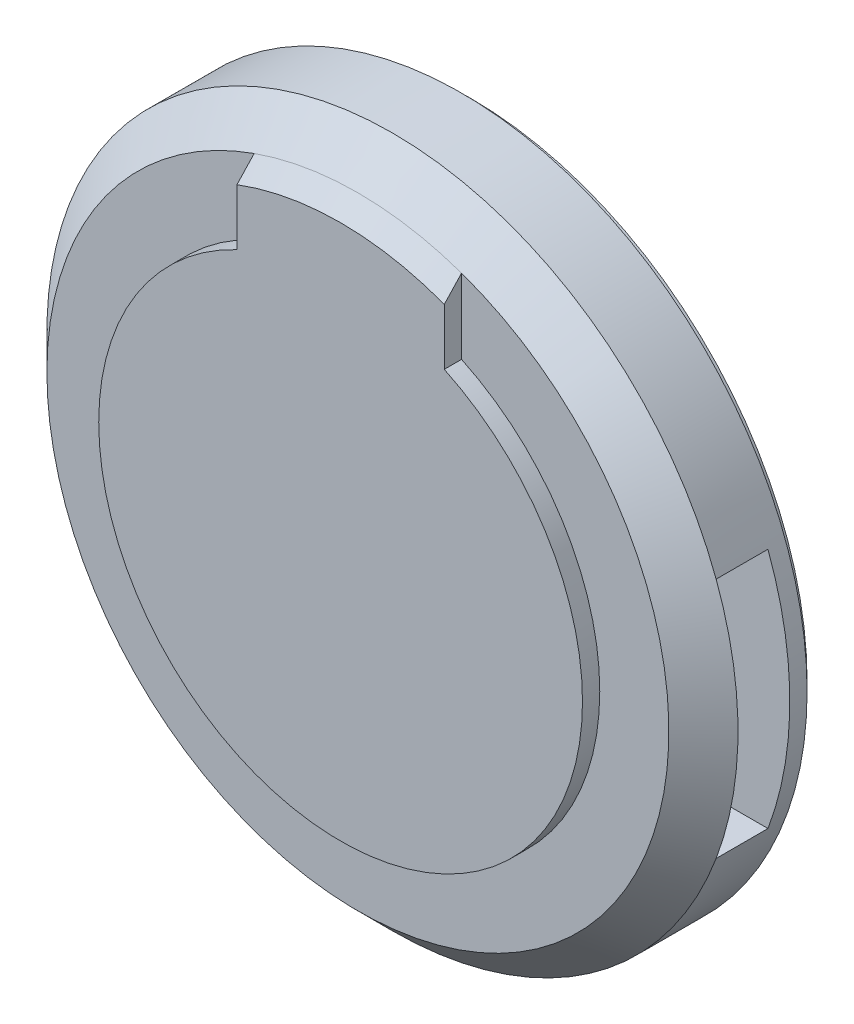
ISO-10303-21;
HEADER;
FILE_DESCRIPTION(('STEP AP214'),'2;1');
FILE_NAME('part.step','',(''),(''),'','','');
FILE_SCHEMA(('AUTOMOTIVE_DESIGN { 1 0 10303 214 1 1 1 1 }'));
ENDSEC;
DATA;
#1=APPLICATION_CONTEXT('core data for automotive mechanical design processes');
#2=APPLICATION_PROTOCOL_DEFINITION('international standard','automotive_design',2000,#1);
#3=PRODUCT_CONTEXT('',#1,'mechanical');
#4=PRODUCT('Part','Part','',(#3));
#5=PRODUCT_RELATED_PRODUCT_CATEGORY('part','',(#4));
#6=PRODUCT_DEFINITION_FORMATION('','',#4);
#7=PRODUCT_DEFINITION_CONTEXT('part definition',#1,'design');
#8=PRODUCT_DEFINITION('design','',#6,#7);
#9=PRODUCT_DEFINITION_SHAPE('','',#8);
#10=(LENGTH_UNIT() NAMED_UNIT(*) SI_UNIT(.MILLI.,.METRE.));
#11=(NAMED_UNIT(*) PLANE_ANGLE_UNIT() SI_UNIT($,.RADIAN.));
#12=(NAMED_UNIT(*) SI_UNIT($,.STERADIAN.) SOLID_ANGLE_UNIT());
#13=UNCERTAINTY_MEASURE_WITH_UNIT(LENGTH_MEASURE(1.E-05),#10,'distance_accuracy_value','');
#14=(GEOMETRIC_REPRESENTATION_CONTEXT(3) GLOBAL_UNCERTAINTY_ASSIGNED_CONTEXT((#13)) GLOBAL_UNIT_ASSIGNED_CONTEXT((#10,
#11,#12)) REPRESENTATION_CONTEXT('',''));
#15=CARTESIAN_POINT('',(0.,0.,0.));
#16=DIRECTION('',(0.,0.,1.));
#17=DIRECTION('',(1.,0.,0.));
#18=AXIS2_PLACEMENT_3D('',#15,#16,#17);
#19=CARTESIAN_POINT('',(0.,0.,-0.5));
#20=DIRECTION('',(0.,0.,-1.));
#21=DIRECTION('',(-1.,0.,0.));
#22=AXIS2_PLACEMENT_3D('',#19,#20,#21);
#23=PLANE('',#22);
#24=CARTESIAN_POINT('',(0.,0.,-0.5));
#25=DIRECTION('',(0.,0.,-1.));
#26=DIRECTION('',(-1.,0.,0.));
#27=AXIS2_PLACEMENT_3D('',#24,#25,#26);
#28=CIRCLE('',#27,19.5);
#29=CARTESIAN_POINT('',(-19.5,0.,-0.5));
#30=VERTEX_POINT('',#29);
#31=EDGE_CURVE('E594',#30,#30,#28,.T.);
#32=ORIENTED_EDGE('',*,*,#31,.T.);
#33=EDGE_LOOP('',(#32));
#34=FACE_BOUND('',#33,.T.);
#35=CARTESIAN_POINT('',(2.30457336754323,-2.35617594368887,-0.5));
#36=CARTESIAN_POINT('',(2.38116524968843,-2.35385738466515,-0.5));
#37=CARTESIAN_POINT('',(2.53148135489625,-2.34930707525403,-0.5));
#38=CARTESIAN_POINT('',(2.75151954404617,-2.31088666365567,-0.5));
#39=CARTESIAN_POINT('',(2.95965408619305,-2.24706047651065,-0.5));
#40=CARTESIAN_POINT('',(3.15700813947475,-2.15903676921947,-0.5));
#41=CARTESIAN_POINT('',(3.34157556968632,-2.04405759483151,-0.5));
#42=CARTESIAN_POINT('',(3.51435802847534,-1.90401931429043,-0.5));
#43=CARTESIAN_POINT('',(3.67645462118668,-1.73961134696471,-0.5));
#44=CARTESIAN_POINT('',(3.77079394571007,-1.61449853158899,-0.5));
#45=CARTESIAN_POINT('',(3.81908921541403,-1.55044934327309,-0.5));
#46=B_SPLINE_CURVE_WITH_KNOTS('',3,(#35,#36,#37,#38,#39,#40,#41,#42,#43,#44,#45),.UNSPECIFIED.,
.F.,.F.,(4,1,1,1,1,1,1,1,4),(0.,0.128464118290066,0.252118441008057,0.373476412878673,
0.49300393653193,0.613708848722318,0.737276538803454,0.865503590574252,1.),.UNSPECIFIED.);
#47=CARTESIAN_POINT('',(2.30457336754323,-2.35617594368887,-0.5));
#48=VERTEX_POINT('',#47);
#49=CARTESIAN_POINT('',(3.81908921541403,-1.55044934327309,-0.5));
#50=VERTEX_POINT('',#49);
#51=EDGE_CURVE('E569',#48,#50,#46,.T.);
#52=ORIENTED_EDGE('',*,*,#51,.T.);
#53=CARTESIAN_POINT('',(3.81908921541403,-1.55044934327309,-0.5));
#54=CARTESIAN_POINT('',(3.86086740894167,-1.48860244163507,-0.5));
#55=CARTESIAN_POINT('',(3.94417650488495,-1.36527471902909,-0.5));
#56=CARTESIAN_POINT('',(4.04927061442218,-1.16731687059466,-0.5));
#57=CARTESIAN_POINT('',(4.13941520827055,-0.960835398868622,-0.5));
#58=CARTESIAN_POINT('',(4.21185573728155,-0.744348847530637,-0.5));
#59=CARTESIAN_POINT('',(4.26990462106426,-0.519115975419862,-0.5));
#60=CARTESIAN_POINT('',(4.31000354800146,-0.284141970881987,-0.5));
#61=CARTESIAN_POINT('',(4.33435866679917,-0.03957729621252,-0.5));
#62=CARTESIAN_POINT('',(4.3375785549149,0.126614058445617,-0.5));
#63=CARTESIAN_POINT('',(4.33921544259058,0.211100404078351,-0.5));
#64=B_SPLINE_CURVE_WITH_KNOTS('',3,(#53,#54,#55,#56,#57,#58,#59,#60,#61,#62,#63),.UNSPECIFIED.,
.F.,.F.,(4,1,1,1,1,1,1,1,4),(0.,0.119866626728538,0.239023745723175,0.359553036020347,
0.481559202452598,0.605468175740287,0.732968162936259,0.864249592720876,1.),.UNSPECIFIED.);
#65=CARTESIAN_POINT('',(4.33921544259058,0.211100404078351,-0.5));
#66=VERTEX_POINT('',#65);
#67=EDGE_CURVE('E528',#50,#66,#64,.T.);
#68=ORIENTED_EDGE('',*,*,#67,.T.);
#69=CARTESIAN_POINT('',(4.33921544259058,0.211100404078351,-0.5));
#70=CARTESIAN_POINT('',(4.33740109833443,0.316432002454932,-0.5));
#71=CARTESIAN_POINT('',(4.33386790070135,0.521551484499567,-0.5));
#72=CARTESIAN_POINT('',(4.30693547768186,0.819776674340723,-0.5));
#73=CARTESIAN_POINT('',(4.26118543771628,1.09914362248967,-0.5));
#74=CARTESIAN_POINT('',(4.19835132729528,1.35992050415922,-0.5));
#75=CARTESIAN_POINT('',(4.11579390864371,1.6016384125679,-0.5));
#76=CARTESIAN_POINT('',(4.01596756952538,1.82523578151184,-0.5));
#77=CARTESIAN_POINT('',(3.89671685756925,2.02967131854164,-0.5));
#78=CARTESIAN_POINT('',(3.75978514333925,2.21404872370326,-0.5));
#79=CARTESIAN_POINT('',(3.61041612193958,2.37870564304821,-0.5));
#80=CARTESIAN_POINT('',(3.44962748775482,2.52141851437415,-0.5));
#81=CARTESIAN_POINT('',(3.28080481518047,2.64346149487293,-0.5));
#82=CARTESIAN_POINT('',(3.10185540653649,2.74161725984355,-0.5));
#83=CARTESIAN_POINT('',(2.91508331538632,2.82057369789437,-0.5));
#84=CARTESIAN_POINT('',(2.71787723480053,2.87342020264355,-0.5));
#85=CARTESIAN_POINT('',(2.51257358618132,2.90874825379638,-0.5));
#86=CARTESIAN_POINT('',(2.37247705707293,2.91215388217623,-0.5));
#87=CARTESIAN_POINT('',(2.3014463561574,2.91388057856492,-0.5));
#88=B_SPLINE_CURVE_WITH_KNOTS('',3,(#69,#70,#71,#72,#73,#74,#75,#76,#77,#78,#79,#80,#81,#82,#83,
#84,#85,#86,#87),.UNSPECIFIED.,.F.,.F.,(4,1,1,1,1,1,1,1,1,1,1,1,1,1,1,1,4),(0.,
0.083191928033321,0.162005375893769,0.236269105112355,0.306625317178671,0.37362573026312,
0.437744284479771,0.499734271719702,0.560167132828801,0.618835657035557,0.675015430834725,
0.729697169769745,0.783009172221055,0.835912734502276,0.889444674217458,0.943947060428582,1.),.UNSPECIFIED.);
#89=CARTESIAN_POINT('',(2.3014463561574,2.91388057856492,-0.5));
#90=VERTEX_POINT('',#89);
#91=EDGE_CURVE('E536',#66,#90,#88,.T.);
#92=ORIENTED_EDGE('',*,*,#91,.T.);
#93=CARTESIAN_POINT('',(2.3014463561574,2.91388057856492,-0.5));
#94=CARTESIAN_POINT('',(2.25484608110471,2.91284872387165,-0.5));
#95=CARTESIAN_POINT('',(2.16280680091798,2.91081072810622,-0.5));
#96=CARTESIAN_POINT('',(2.02631483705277,2.89546363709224,-0.5));
#97=CARTESIAN_POINT('',(1.89298940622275,2.87226690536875,-0.5));
#98=CARTESIAN_POINT('',(1.76294700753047,2.8369755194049,-0.5));
#99=CARTESIAN_POINT('',(1.63547622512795,2.79362155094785,-0.5));
#100=CARTESIAN_POINT('',(1.51152594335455,2.73923952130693,-0.5));
#101=CARTESIAN_POINT('',(1.39101145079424,2.67487580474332,-0.5));
#102=CARTESIAN_POINT('',(1.27344190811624,2.60257683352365,-0.5));
#103=CARTESIAN_POINT('',(1.16061996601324,2.519849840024,-0.5));
#104=CARTESIAN_POINT('',(1.05342512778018,2.42811065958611,-0.5));
#105=CARTESIAN_POINT('',(0.951703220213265,2.32773564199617,-0.5));
#106=CARTESIAN_POINT('',(0.857076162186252,2.21793139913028,-0.5));
#107=CARTESIAN_POINT('',(0.767967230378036,2.09974150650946,-0.5));
#108=CARTESIAN_POINT('',(0.685861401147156,1.97235023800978,-0.5));
#109=CARTESIAN_POINT('',(0.609635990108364,1.83607569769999,-0.5));
#110=CARTESIAN_POINT('',(0.538950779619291,1.69183167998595,-0.5));
#111=CARTESIAN_POINT('',(0.475331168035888,1.53949073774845,-0.5));
#112=CARTESIAN_POINT('',(0.419727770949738,1.37986635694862,-0.5));
#113=CARTESIAN_POINT('',(0.374667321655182,1.21239015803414,-0.5));
#114=CARTESIAN_POINT('',(0.335429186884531,1.03870374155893,-0.5));
#115=CARTESIAN_POINT('',(0.307031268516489,0.857184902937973,-0.5));
#116=CARTESIAN_POINT('',(0.284682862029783,0.669153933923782,-0.5));
#117=CARTESIAN_POINT('',(0.272316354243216,0.473589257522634,-0.5));
#118=CARTESIAN_POINT('',(0.270735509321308,0.34106112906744,-0.5));
#119=CARTESIAN_POINT('',(0.269931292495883,0.27364063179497,-0.5));
#120=B_SPLINE_CURVE_WITH_KNOTS('',3,(#93,#94,#95,#96,#97,#98,#99,#100,#101,#102,#103,#104,#105,
#106,#107,#108,#109,#110,#111,#112,#113,#114,#115,#116,#117,#118,#119),.UNSPECIFIED.,.F.,.F.,(4,
1,1,1,1,1,1,1,1,1,1,1,1,1,1,1,1,1,1,1,1,1,1,1,4),(0.,0.0374926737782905,0.0740510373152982,
0.110413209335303,0.146290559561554,0.182366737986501,0.21867727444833,0.255074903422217,
0.292240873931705,0.329654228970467,0.367532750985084,0.405690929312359,0.444540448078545,
0.48407613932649,0.52471465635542,0.566401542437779,0.609667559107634,0.653909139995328,
0.699182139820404,0.745579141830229,0.793404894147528,0.842405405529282,0.89335275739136,
0.945745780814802,1.),.UNSPECIFIED.);
#121=CARTESIAN_POINT('',(0.269931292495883,0.27364063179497,-0.5));
#122=VERTEX_POINT('',#121);
#123=EDGE_CURVE('E545',#90,#122,#120,.T.);
#124=ORIENTED_EDGE('',*,*,#123,.T.);
#125=CARTESIAN_POINT('',(0.269931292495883,0.27364063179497,-0.5));
#126=CARTESIAN_POINT('',(0.271608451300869,0.181524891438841,-0.5));
#127=CARTESIAN_POINT('',(0.274892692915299,0.00114224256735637,-0.5));
#128=CARTESIAN_POINT('',(0.298341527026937,-0.263058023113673,-0.5));
#129=CARTESIAN_POINT('',(0.340984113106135,-0.513835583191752,-0.5));
#130=CARTESIAN_POINT('',(0.395810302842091,-0.752472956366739,-0.5));
#131=CARTESIAN_POINT('',(0.47047341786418,-0.977102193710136,-0.5));
#132=CARTESIAN_POINT('',(0.560362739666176,-1.18885864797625,-0.5));
#133=CARTESIAN_POINT('',(0.665813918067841,-1.38834918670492,-0.5));
#134=CARTESIAN_POINT('',(0.750921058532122,-1.51059157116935,-0.5));
#135=CARTESIAN_POINT('',(0.793184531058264,-1.5712960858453,-0.5));
#136=B_SPLINE_CURVE_WITH_KNOTS('',3,(#125,#126,#127,#128,#129,#130,#131,#132,#133,#134,#135),
.UNSPECIFIED.,.F.,.F.,(4,1,1,1,1,1,1,1,4),(0.,0.141690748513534,0.277461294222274,
0.407495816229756,0.532718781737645,0.653726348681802,0.771059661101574,0.886310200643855,1.),.UNSPECIFIED.);
#137=CARTESIAN_POINT('',(0.793184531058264,-1.5712960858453,-0.5));
#138=VERTEX_POINT('',#137);
#139=EDGE_CURVE('E553',#122,#138,#136,.T.);
#140=ORIENTED_EDGE('',*,*,#139,.T.);
#141=CARTESIAN_POINT('',(0.793184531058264,-1.5712960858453,-0.5));
#142=CARTESIAN_POINT('',(0.841939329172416,-1.63354222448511,-0.5));
#143=CARTESIAN_POINT('',(0.937236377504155,-1.75520970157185,-0.5));
#144=CARTESIAN_POINT('',(1.09932437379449,-1.91607567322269,-0.5));
#145=CARTESIAN_POINT('',(1.27262450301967,-2.05192031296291,-0.5));
#146=CARTESIAN_POINT('',(1.45682820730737,-2.16453791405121,-0.5));
#147=CARTESIAN_POINT('',(1.65321174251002,-2.24983329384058,-0.5));
#148=CARTESIAN_POINT('',(1.86021334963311,-2.31194753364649,-0.5));
#149=CARTESIAN_POINT('',(2.07879280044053,-2.349060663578,-0.5));
#150=CARTESIAN_POINT('',(2.22833945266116,-2.35377349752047,-0.5));
#151=CARTESIAN_POINT('',(2.30457336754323,-2.35617594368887,-0.5));
#152=B_SPLINE_CURVE_WITH_KNOTS('',3,(#141,#142,#143,#144,#145,#146,#147,#148,#149,#150,#151),
.UNSPECIFIED.,.F.,.F.,(4,1,1,1,1,1,1,1,4),(0.,0.133764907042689,0.261459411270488,
0.385485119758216,0.505836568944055,0.625946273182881,0.746912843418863,0.87098457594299,1.),.UNSPECIFIED.);
#153=EDGE_CURVE('E561',#138,#48,#152,.T.);
#154=ORIENTED_EDGE('',*,*,#153,.T.);
#155=EDGE_LOOP('',(#52,#68,#92,#124,#140,#154));
#156=FACE_BOUND('',#155,.T.);
#157=DIRECTION('',(0.,-1.,0.));
#158=VECTOR('',#157,1.);
#159=CARTESIAN_POINT('',(-0.930841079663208,2.19362562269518,-0.5));
#160=LINE('',#159,#158);
#161=CARTESIAN_POINT('',(-0.930841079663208,2.19362562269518,-0.5));
#162=VERTEX_POINT('',#161);
#163=CARTESIAN_POINT('',(-0.930841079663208,-2.28946636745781,-0.5));
#164=VERTEX_POINT('',#163);
#165=EDGE_CURVE('E445',#162,#164,#160,.T.);
#166=ORIENTED_EDGE('',*,*,#165,.T.);
#167=DIRECTION('',(1.,0.,0.));
#168=VECTOR('',#167,1.);
#169=CARTESIAN_POINT('',(-0.930841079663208,-2.28946636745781,-0.5));
#170=LINE('',#169,#168);
#171=CARTESIAN_POINT('',(-0.397164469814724,-2.28946636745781,-0.5));
#172=VERTEX_POINT('',#171);
#173=EDGE_CURVE('E397',#164,#172,#170,.T.);
#174=ORIENTED_EDGE('',*,*,#173,.T.);
#175=DIRECTION('',(0.,1.,0.));
#176=VECTOR('',#175,1.);
#177=CARTESIAN_POINT('',(-0.397164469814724,-2.28946636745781,-0.5));
#178=LINE('',#177,#176);
#179=CARTESIAN_POINT('',(-0.397164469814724,2.84717100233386,-0.5));
#180=VERTEX_POINT('',#179);
#181=EDGE_CURVE('E400',#172,#180,#178,.T.);
#182=ORIENTED_EDGE('',*,*,#181,.T.);
#183=DIRECTION('',(-1.,0.,0.));
#184=VECTOR('',#183,1.);
#185=CARTESIAN_POINT('',(-0.397164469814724,2.84717100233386,-0.5));
#186=LINE('',#185,#184);
#187=CARTESIAN_POINT('',(-1.23207650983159,2.84717100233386,-0.5));
#188=VERTEX_POINT('',#187);
#189=EDGE_CURVE('E404',#180,#188,#186,.T.);
#190=ORIENTED_EDGE('',*,*,#189,.T.);
#191=DIRECTION('',(-0.26503443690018,-0.964238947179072,0.));
#192=VECTOR('',#191,1.);
#193=CARTESIAN_POINT('',(-1.23207650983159,2.84717100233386,-0.5));
#194=LINE('',#193,#192);
#195=CARTESIAN_POINT('',(-2.23167781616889,-0.789543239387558,-0.5));
#196=VERTEX_POINT('',#195);
#197=EDGE_CURVE('E407',#188,#196,#194,.T.);
#198=ORIENTED_EDGE('',*,*,#197,.T.);
#199=DIRECTION('',(-0.254362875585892,-0.967108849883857,0.));
#200=VECTOR('',#199,1.);
#201=CARTESIAN_POINT('',(-2.23167781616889,-0.789543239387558,-0.5));
#202=LINE('',#201,#200);
#203=CARTESIAN_POINT('',(-2.43180654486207,-1.55044934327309,-0.5));
#204=VERTEX_POINT('',#203);
#205=EDGE_CURVE('E410',#196,#204,#202,.T.);
#206=ORIENTED_EDGE('',*,*,#205,.T.);
#207=CARTESIAN_POINT('',(-2.43180654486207,-1.55044934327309,-0.5));
#208=CARTESIAN_POINT('',(-2.4383347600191,-1.5254135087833,-0.5));
#209=CARTESIAN_POINT('',(-2.45205232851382,-1.47280636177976,-0.5));
#210=CARTESIAN_POINT('',(-2.47532763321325,-1.38985634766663,-0.5));
#211=CARTESIAN_POINT('',(-2.50159004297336,-1.29907786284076,-0.5));
#212=CARTESIAN_POINT('',(-2.52807532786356,-1.19969043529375,-0.5));
#213=CARTESIAN_POINT('',(-2.55865478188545,-1.09311862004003,-0.5));
#214=CARTESIAN_POINT('',(-2.59217537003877,-0.978610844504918,-0.5));
#215=CARTESIAN_POINT('',(-2.62755754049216,-0.855597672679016,-0.5));
#216=CARTESIAN_POINT('',(-2.65175578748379,-0.770785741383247,-0.5));
#217=CARTESIAN_POINT('',(-2.66424772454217,-0.727003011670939,-0.5));
#218=B_SPLINE_CURVE_WITH_KNOTS('',3,(#207,#208,#209,#210,#211,#212,#213,#214,#215,#216,#217),
.UNSPECIFIED.,.F.,.F.,(4,1,1,1,1,1,1,1,4),(0.,0.0907120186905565,0.190610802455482,
0.302053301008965,0.422037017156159,0.551216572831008,0.690772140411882,0.840366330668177,1.),.UNSPECIFIED.);
#219=CARTESIAN_POINT('',(-2.66424772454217,-0.727003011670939,-0.5));
#220=VERTEX_POINT('',#219);
#221=EDGE_CURVE('E413',#204,#220,#218,.T.);
#222=ORIENTED_EDGE('',*,*,#221,.T.);
#223=DIRECTION('',(-0.280999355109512,0.959707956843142,0.));
#224=VECTOR('',#223,1.);
#225=CARTESIAN_POINT('',(-2.66424772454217,-0.727003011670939,-0.5));
#226=LINE('',#225,#224);
#227=CARTESIAN_POINT('',(-3.71075420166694,2.84717100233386,-0.5));
#228=VERTEX_POINT('',#227);
#229=EDGE_CURVE('E418',#220,#228,#226,.T.);
#230=ORIENTED_EDGE('',*,*,#229,.T.);
#231=DIRECTION('',(-1.,0.,0.));
#232=VECTOR('',#231,1.);
#233=CARTESIAN_POINT('',(-3.71075420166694,2.84717100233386,-0.5));
#234=LINE('',#233,#232);
#235=CARTESIAN_POINT('',(-4.46644861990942,2.84717100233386,-0.5));
#236=VERTEX_POINT('',#235);
#237=EDGE_CURVE('E424',#228,#236,#234,.T.);
#238=ORIENTED_EDGE('',*,*,#237,.T.);
#239=DIRECTION('',(0.,-1.,0.));
#240=VECTOR('',#239,1.);
#241=CARTESIAN_POINT('',(-4.46644861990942,2.84717100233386,-0.5));
#242=LINE('',#241,#240);
#243=CARTESIAN_POINT('',(-4.46644861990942,-2.28946636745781,-0.5));
#244=VERTEX_POINT('',#243);
#245=EDGE_CURVE('E427',#236,#244,#242,.T.);
#246=ORIENTED_EDGE('',*,*,#245,.T.);
#247=DIRECTION('',(1.,0.,0.));
#248=VECTOR('',#247,1.);
#249=CARTESIAN_POINT('',(-4.46644861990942,-2.28946636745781,-0.5));
#250=LINE('',#249,#248);
#251=CARTESIAN_POINT('',(-3.93277201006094,-2.28946636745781,-0.5));
#252=VERTEX_POINT('',#251);
#253=EDGE_CURVE('E430',#244,#252,#250,.T.);
#254=ORIENTED_EDGE('',*,*,#253,.T.);
#255=DIRECTION('',(0.,1.,0.));
#256=VECTOR('',#255,1.);
#257=CARTESIAN_POINT('',(-3.93277201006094,-2.28946636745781,-0.5));
#258=LINE('',#257,#256);
#259=CARTESIAN_POINT('',(-3.93277201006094,1.95076107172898,-0.5));
#260=VERTEX_POINT('',#259);
#261=EDGE_CURVE('E433',#252,#260,#258,.T.);
#262=ORIENTED_EDGE('',*,*,#261,.T.);
#263=DIRECTION('',(0.279238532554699,-0.960221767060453,0.));
#264=VECTOR('',#263,1.);
#265=CARTESIAN_POINT('',(-3.93277201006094,1.95076107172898,-0.5));
#266=LINE('',#265,#264);
#267=CARTESIAN_POINT('',(-2.69968718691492,-2.28946636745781,-0.5));
#268=VERTEX_POINT('',#267);
#269=EDGE_CURVE('E436',#260,#268,#266,.T.);
#270=ORIENTED_EDGE('',*,*,#269,.T.);
#271=DIRECTION('',(1.,0.,0.));
#272=VECTOR('',#271,1.);
#273=CARTESIAN_POINT('',(-2.69968718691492,-2.28946636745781,-0.5));
#274=LINE('',#273,#272);
#275=CARTESIAN_POINT('',(-2.15350253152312,-2.28946636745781,-0.5));
#276=VERTEX_POINT('',#275);
#277=EDGE_CURVE('E439',#268,#276,#274,.T.);
#278=ORIENTED_EDGE('',*,*,#277,.T.);
#279=DIRECTION('',(0.263117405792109,0.964763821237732,0.));
#280=VECTOR('',#279,1.);
#281=CARTESIAN_POINT('',(-2.15350253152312,-2.28946636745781,-0.5));
#282=LINE('',#281,#280);
#283=EDGE_CURVE('E442',#276,#162,#282,.T.);
#284=ORIENTED_EDGE('',*,*,#283,.T.);
#285=EDGE_LOOP('',(#166,#174,#182,#190,#198,#206,#222,#230,#238,#246,#254,#262,#270,#278,#284));
#286=FACE_BOUND('',#285,.T.);
#287=ADVANCED_FACE('F35',(#34,#156,#286),#23,.T.);
#288=CARTESIAN_POINT('',(0.,0.,6.));
#289=DIRECTION('',(0.,0.,-1.));
#290=DIRECTION('',(-1.,0.,0.));
#291=AXIS2_PLACEMENT_3D('',#288,#289,#290);
#292=CYLINDRICAL_SURFACE('',#291,20.);
#293=CARTESIAN_POINT('',(0.,0.,0.999999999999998));
#294=DIRECTION('',(0.,0.,-1.));
#295=DIRECTION('',(-1.,0.,0.));
#296=AXIS2_PLACEMENT_3D('',#293,#294,#295);
#297=CIRCLE('',#296,20.);
#298=CARTESIAN_POINT('',(-18.7349939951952,-7.,0.999999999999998));
#299=VERTEX_POINT('',#298);
#300=CARTESIAN_POINT('',(-18.7349939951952,7.,0.999999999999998));
#301=VERTEX_POINT('',#300);
#302=EDGE_CURVE('E11',#299,#301,#297,.T.);
#303=ORIENTED_EDGE('',*,*,#302,.T.);
#304=DIRECTION('',(0.,0.,-1.));
#305=VECTOR('',#304,1.);
#306=CARTESIAN_POINT('',(-18.7349939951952,7.,6.));
#307=LINE('',#306,#305);
#308=CARTESIAN_POINT('',(-18.7349939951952,7.,4.));
#309=VERTEX_POINT('',#308);
#310=EDGE_CURVE('E268',#301,#309,#307,.F.);
#311=ORIENTED_EDGE('',*,*,#310,.T.);
#312=CARTESIAN_POINT('',(0.,0.,4.00000000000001));
#313=DIRECTION('',(0.,0.,1.));
#314=DIRECTION('',(1.,0.,0.));
#315=AXIS2_PLACEMENT_3D('',#312,#313,#314);
#316=CIRCLE('',#315,20.);
#317=CARTESIAN_POINT('',(18.7349939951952,7.,4.00000000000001));
#318=VERTEX_POINT('',#317);
#319=EDGE_CURVE('E281',#309,#318,#316,.F.);
#320=ORIENTED_EDGE('',*,*,#319,.T.);
#321=DIRECTION('',(0.,0.,-1.));
#322=VECTOR('',#321,1.);
#323=CARTESIAN_POINT('',(18.7349939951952,7.,6.));
#324=LINE('',#323,#322);
#325=CARTESIAN_POINT('',(18.7349939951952,7.,0.999999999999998));
#326=VERTEX_POINT('',#325);
#327=EDGE_CURVE('E609',#318,#326,#324,.T.);
#328=ORIENTED_EDGE('',*,*,#327,.T.);
#329=CARTESIAN_POINT('',(18.7349939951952,-7.,0.999999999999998));
#330=VERTEX_POINT('',#329);
#331=EDGE_CURVE('E40',#326,#330,#297,.T.);
#332=ORIENTED_EDGE('',*,*,#331,.T.);
#333=DIRECTION('',(0.,0.,-1.));
#334=VECTOR('',#333,1.);
#335=CARTESIAN_POINT('',(18.7349939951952,-7.,6.));
#336=LINE('',#335,#334);
#337=CARTESIAN_POINT('',(18.7349939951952,-7.,4.));
#338=VERTEX_POINT('',#337);
#339=EDGE_CURVE('E269',#330,#338,#336,.F.);
#340=ORIENTED_EDGE('',*,*,#339,.T.);
#341=CARTESIAN_POINT('',(-18.7349939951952,-7.,4.));
#342=VERTEX_POINT('',#341);
#343=EDGE_CURVE('E279',#338,#342,#316,.F.);
#344=ORIENTED_EDGE('',*,*,#343,.T.);
#345=DIRECTION('',(0.,0.,-1.));
#346=VECTOR('',#345,1.);
#347=CARTESIAN_POINT('',(-18.7349939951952,-7.,6.));
#348=LINE('',#347,#346);
#349=EDGE_CURVE('E259',#342,#299,#348,.T.);
#350=ORIENTED_EDGE('',*,*,#349,.T.);
#351=EDGE_LOOP('',(#303,#311,#320,#328,#332,#340,#344,#350));
#352=FACE_BOUND('',#351,.T.);
#353=CARTESIAN_POINT('',(0.,0.,0.));
#354=DIRECTION('',(0.,0.,1.));
#355=DIRECTION('',(1.,0.,0.));
#356=AXIS2_PLACEMENT_3D('',#353,#354,#355);
#357=CIRCLE('',#356,20.);
#358=CARTESIAN_POINT('',(20.,0.,0.));
#359=VERTEX_POINT('',#358);
#360=EDGE_CURVE('E596',#359,#359,#357,.T.);
#361=ORIENTED_EDGE('',*,*,#360,.T.);
#362=EDGE_LOOP('',(#361));
#363=FACE_BOUND('',#362,.T.);
#364=ADVANCED_FACE('F283',(#352,#363),#292,.T.);
#365=CARTESIAN_POINT('',(0.,0.,6.));
#366=DIRECTION('',(0.,0.,1.));
#367=DIRECTION('',(1.,0.,0.));
#368=AXIS2_PLACEMENT_3D('',#365,#366,#367);
#369=PLANE('',#368);
#370=DIRECTION('',(0.,-1.,0.));
#371=VECTOR('',#370,1.);
#372=CARTESIAN_POINT('',(-6.,12.6491106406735,6.));
#373=LINE('',#372,#371);
#374=CARTESIAN_POINT('',(-6.,16.9705627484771,6.));
#375=VERTEX_POINT('',#374);
#376=CARTESIAN_POINT('',(-6.,12.6491106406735,6.));
#377=VERTEX_POINT('',#376);
#378=EDGE_CURVE('E623',#375,#377,#373,.T.);
#379=ORIENTED_EDGE('',*,*,#378,.F.);
#380=CARTESIAN_POINT('',(0.,0.,6.));
#381=DIRECTION('',(0.,0.,1.));
#382=DIRECTION('',(1.,0.,0.));
#383=AXIS2_PLACEMENT_3D('',#380,#381,#382);
#384=CIRCLE('',#383,18.);
#385=CARTESIAN_POINT('',(6.,16.9705627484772,6.));
#386=VERTEX_POINT('',#385);
#387=EDGE_CURVE('E598',#375,#386,#384,.T.);
#388=ORIENTED_EDGE('',*,*,#387,.T.);
#389=DIRECTION('',(0.,1.,0.));
#390=VECTOR('',#389,1.);
#391=CARTESIAN_POINT('',(6.,12.6491106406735,6.));
#392=LINE('',#391,#390);
#393=CARTESIAN_POINT('',(6.,12.6491106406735,6.));
#394=VERTEX_POINT('',#393);
#395=EDGE_CURVE('E631',#394,#386,#392,.T.);
#396=ORIENTED_EDGE('',*,*,#395,.F.);
#397=CARTESIAN_POINT('',(0.,0.,6.));
#398=DIRECTION('',(0.,0.,1.));
#399=DIRECTION('',(1.,0.,0.));
#400=AXIS2_PLACEMENT_3D('',#397,#398,#399);
#401=CIRCLE('',#400,14.);
#402=EDGE_CURVE('E615',#377,#394,#401,.T.);
#403=ORIENTED_EDGE('',*,*,#402,.F.);
#404=EDGE_LOOP('',(#379,#388,#396,#403));
#405=FACE_BOUND('',#404,.T.);
#406=ADVANCED_FACE('F713',(#405),#369,.T.);
#407=CARTESIAN_POINT('',(0.,0.,0.));
#408=DIRECTION('',(0.,0.,1.));
#409=DIRECTION('',(1.,0.,0.));
#410=AXIS2_PLACEMENT_3D('',#407,#408,#409);
#411=PLANE('',#410);
#412=CARTESIAN_POINT('',(0.,0.,0.));
#413=DIRECTION('',(0.,0.,1.));
#414=DIRECTION('',(1.,0.,0.));
#415=AXIS2_PLACEMENT_3D('',#412,#413,#414);
#416=CIRCLE('',#415,19.5);
#417=CARTESIAN_POINT('',(19.5,0.,0.));
#418=VERTEX_POINT('',#417);
#419=EDGE_CURVE('E286',#418,#418,#416,.F.);
#420=ORIENTED_EDGE('',*,*,#419,.F.);
#421=EDGE_LOOP('',(#420));
#422=FACE_BOUND('',#421,.T.);
#423=ORIENTED_EDGE('',*,*,#360,.F.);
#424=EDGE_LOOP('',(#423));
#425=FACE_BOUND('',#424,.T.);
#426=ADVANCED_FACE('F727',(#422,#425),#411,.F.);
#427=CARTESIAN_POINT('',(0.,0.,6.));
#428=DIRECTION('',(0.,0.,-1.));
#429=DIRECTION('',(-1.,0.,0.));
#430=AXIS2_PLACEMENT_3D('',#427,#428,#429);
#431=CONICAL_SURFACE('',#430,18.,0.785398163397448);
#432=EDGE_CURVE('E51',#318,#338,#316,.F.);
#433=ORIENTED_EDGE('',*,*,#432,.F.);
#434=ORIENTED_EDGE('',*,*,#319,.F.);
#435=EDGE_CURVE('E274',#342,#309,#316,.F.);
#436=ORIENTED_EDGE('',*,*,#435,.F.);
#437=ORIENTED_EDGE('',*,*,#343,.F.);
#438=EDGE_LOOP('',(#433,#434,#436,#437));
#439=FACE_BOUND('',#438,.T.);
#440=EDGE_CURVE('E289',#386,#375,#384,.T.);
#441=ORIENTED_EDGE('',*,*,#440,.F.);
#442=ORIENTED_EDGE('',*,*,#387,.F.);
#443=EDGE_LOOP('',(#441,#442));
#444=FACE_BOUND('',#443,.T.);
#445=ADVANCED_FACE('F277',(#439,#444),#431,.T.);
#446=CARTESIAN_POINT('',(0.,0.,-0.5));
#447=DIRECTION('',(0.,0.,1.));
#448=DIRECTION('',(1.,0.,0.));
#449=AXIS2_PLACEMENT_3D('',#446,#447,#448);
#450=CYLINDRICAL_SURFACE('',#449,19.5);
#451=ORIENTED_EDGE('',*,*,#31,.F.);
#452=EDGE_LOOP('',(#451));
#453=FACE_BOUND('',#452,.T.);
#454=ORIENTED_EDGE('',*,*,#419,.T.);
#455=EDGE_LOOP('',(#454));
#456=FACE_BOUND('',#455,.T.);
#457=ADVANCED_FACE('F721',(#453,#456),#450,.T.);
#458=CARTESIAN_POINT('',(3.81908921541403,-1.55044934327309,0.));
#459=CARTESIAN_POINT('',(3.86086740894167,-1.48860244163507,0.));
#460=CARTESIAN_POINT('',(3.94417650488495,-1.36527471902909,0.));
#461=CARTESIAN_POINT('',(4.04927061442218,-1.16731687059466,0.));
#462=CARTESIAN_POINT('',(4.13941520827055,-0.960835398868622,0.));
#463=CARTESIAN_POINT('',(4.21185573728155,-0.744348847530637,0.));
#464=CARTESIAN_POINT('',(4.26990462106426,-0.519115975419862,0.));
#465=CARTESIAN_POINT('',(4.31000354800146,-0.284141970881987,0.));
#466=CARTESIAN_POINT('',(4.33435866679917,-0.03957729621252,0.));
#467=CARTESIAN_POINT('',(4.3375785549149,0.126614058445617,0.));
#468=CARTESIAN_POINT('',(4.33921544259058,0.211100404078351,0.));
#469=B_SPLINE_CURVE_WITH_KNOTS('',3,(#458,#459,#460,#461,#462,#463,#464,#465,#466,#467,#468),
.UNSPECIFIED.,.F.,.F.,(4,1,1,1,1,1,1,1,4),(0.,0.119866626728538,0.239023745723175,
0.359553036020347,0.481559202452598,0.605468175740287,0.732968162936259,0.864249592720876,1.),.UNSPECIFIED.);
#470=DIRECTION('',(0.,0.,-1.));
#471=VECTOR('',#470,1.);
#472=SURFACE_OF_LINEAR_EXTRUSION('',#469,#471);
#473=ORIENTED_EDGE('',*,*,#67,.F.);
#474=DIRECTION('',(0.,0.,-1.));
#475=VECTOR('',#474,1.);
#476=CARTESIAN_POINT('',(3.81908921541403,-1.55044934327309,0.));
#477=LINE('',#476,#475);
#478=CARTESIAN_POINT('',(3.81908921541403,-1.55044934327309,0.));
#479=VERTEX_POINT('',#478);
#480=EDGE_CURVE('E522',#479,#50,#477,.T.);
#481=ORIENTED_EDGE('',*,*,#480,.F.);
#482=CARTESIAN_POINT('',(4.33921544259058,0.211100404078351,0.));
#483=VERTEX_POINT('',#482);
#484=EDGE_CURVE('E577',#479,#483,#469,.T.);
#485=ORIENTED_EDGE('',*,*,#484,.T.);
#486=DIRECTION('',(0.,0.,-1.));
#487=VECTOR('',#486,1.);
#488=CARTESIAN_POINT('',(4.33921544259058,0.211100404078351,0.));
#489=LINE('',#488,#487);
#490=EDGE_CURVE('E591',#483,#66,#489,.T.);
#491=ORIENTED_EDGE('',*,*,#490,.T.);
#492=EDGE_LOOP('',(#473,#481,#485,#491));
#493=FACE_BOUND('',#492,.T.);
#494=ADVANCED_FACE('F718',(#493),#472,.T.);
#495=CARTESIAN_POINT('',(4.33921544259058,0.211100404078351,0.));
#496=CARTESIAN_POINT('',(4.33740109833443,0.316432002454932,0.));
#497=CARTESIAN_POINT('',(4.33386790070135,0.521551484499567,0.));
#498=CARTESIAN_POINT('',(4.30693547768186,0.819776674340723,0.));
#499=CARTESIAN_POINT('',(4.26118543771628,1.09914362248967,0.));
#500=CARTESIAN_POINT('',(4.19835132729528,1.35992050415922,0.));
#501=CARTESIAN_POINT('',(4.11579390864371,1.6016384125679,0.));
#502=CARTESIAN_POINT('',(4.01596756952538,1.82523578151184,0.));
#503=CARTESIAN_POINT('',(3.89671685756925,2.02967131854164,0.));
#504=CARTESIAN_POINT('',(3.75978514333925,2.21404872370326,0.));
#505=CARTESIAN_POINT('',(3.61041612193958,2.37870564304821,0.));
#506=CARTESIAN_POINT('',(3.44962748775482,2.52141851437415,0.));
#507=CARTESIAN_POINT('',(3.28080481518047,2.64346149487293,0.));
#508=CARTESIAN_POINT('',(3.10185540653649,2.74161725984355,0.));
#509=CARTESIAN_POINT('',(2.91508331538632,2.82057369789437,0.));
#510=CARTESIAN_POINT('',(2.71787723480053,2.87342020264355,0.));
#511=CARTESIAN_POINT('',(2.51257358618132,2.90874825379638,0.));
#512=CARTESIAN_POINT('',(2.37247705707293,2.91215388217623,0.));
#513=CARTESIAN_POINT('',(2.3014463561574,2.91388057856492,0.));
#514=B_SPLINE_CURVE_WITH_KNOTS('',3,(#495,#496,#497,#498,#499,#500,#501,#502,#503,#504,#505,
#506,#507,#508,#509,#510,#511,#512,#513),.UNSPECIFIED.,.F.,.F.,(4,1,1,1,1,1,1,1,1,1,1,1,1,1,1,1,
4),(0.,0.083191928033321,0.162005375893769,0.236269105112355,0.306625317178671,0.37362573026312,
0.437744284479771,0.499734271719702,0.560167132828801,0.618835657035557,0.675015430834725,
0.729697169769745,0.783009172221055,0.835912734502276,0.889444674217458,0.943947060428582,1.),.UNSPECIFIED.);
#515=DIRECTION('',(0.,0.,-1.));
#516=VECTOR('',#515,1.);
#517=SURFACE_OF_LINEAR_EXTRUSION('',#514,#516);
#518=ORIENTED_EDGE('',*,*,#91,.F.);
#519=ORIENTED_EDGE('',*,*,#490,.F.);
#520=CARTESIAN_POINT('',(2.3014463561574,2.91388057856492,0.));
#521=VERTEX_POINT('',#520);
#522=EDGE_CURVE('E1111',#483,#521,#514,.T.);
#523=ORIENTED_EDGE('',*,*,#522,.T.);
#524=DIRECTION('',(0.,0.,-1.));
#525=VECTOR('',#524,1.);
#526=CARTESIAN_POINT('',(2.3014463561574,2.91388057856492,0.));
#527=LINE('',#526,#525);
#528=EDGE_CURVE('E589',#521,#90,#527,.T.);
#529=ORIENTED_EDGE('',*,*,#528,.T.);
#530=EDGE_LOOP('',(#518,#519,#523,#529));
#531=FACE_BOUND('',#530,.T.);
#532=ADVANCED_FACE('F748',(#531),#517,.T.);
#533=CARTESIAN_POINT('',(2.3014463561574,2.91388057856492,0.));
#534=CARTESIAN_POINT('',(2.25484608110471,2.91284872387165,0.));
#535=CARTESIAN_POINT('',(2.16280680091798,2.91081072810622,0.));
#536=CARTESIAN_POINT('',(2.02631483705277,2.89546363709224,0.));
#537=CARTESIAN_POINT('',(1.89298940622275,2.87226690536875,0.));
#538=CARTESIAN_POINT('',(1.76294700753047,2.8369755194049,0.));
#539=CARTESIAN_POINT('',(1.63547622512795,2.79362155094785,0.));
#540=CARTESIAN_POINT('',(1.51152594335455,2.73923952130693,0.));
#541=CARTESIAN_POINT('',(1.39101145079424,2.67487580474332,0.));
#542=CARTESIAN_POINT('',(1.27344190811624,2.60257683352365,0.));
#543=CARTESIAN_POINT('',(1.16061996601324,2.519849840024,0.));
#544=CARTESIAN_POINT('',(1.05342512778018,2.42811065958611,0.));
#545=CARTESIAN_POINT('',(0.951703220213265,2.32773564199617,0.));
#546=CARTESIAN_POINT('',(0.857076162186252,2.21793139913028,0.));
#547=CARTESIAN_POINT('',(0.767967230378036,2.09974150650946,0.));
#548=CARTESIAN_POINT('',(0.685861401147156,1.97235023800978,0.));
#549=CARTESIAN_POINT('',(0.609635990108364,1.83607569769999,0.));
#550=CARTESIAN_POINT('',(0.538950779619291,1.69183167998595,0.));
#551=CARTESIAN_POINT('',(0.475331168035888,1.53949073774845,0.));
#552=CARTESIAN_POINT('',(0.419727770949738,1.37986635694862,0.));
#553=CARTESIAN_POINT('',(0.374667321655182,1.21239015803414,0.));
#554=CARTESIAN_POINT('',(0.335429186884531,1.03870374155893,0.));
#555=CARTESIAN_POINT('',(0.307031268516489,0.857184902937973,0.));
#556=CARTESIAN_POINT('',(0.284682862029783,0.669153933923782,0.));
#557=CARTESIAN_POINT('',(0.272316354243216,0.473589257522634,0.));
#558=CARTESIAN_POINT('',(0.270735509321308,0.34106112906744,0.));
#559=CARTESIAN_POINT('',(0.269931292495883,0.27364063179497,0.));
#560=B_SPLINE_CURVE_WITH_KNOTS('',3,(#533,#534,#535,#536,#537,#538,#539,#540,#541,#542,#543,
#544,#545,#546,#547,#548,#549,#550,#551,#552,#553,#554,#555,#556,#557,#558,#559),.UNSPECIFIED.,
.F.,.F.,(4,1,1,1,1,1,1,1,1,1,1,1,1,1,1,1,1,1,1,1,1,1,1,1,4),(0.,0.0374926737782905,
0.0740510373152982,0.110413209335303,0.146290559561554,0.182366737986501,0.21867727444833,
0.255074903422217,0.292240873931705,0.329654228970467,0.367532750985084,0.405690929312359,
0.444540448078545,0.48407613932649,0.52471465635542,0.566401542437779,0.609667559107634,
0.653909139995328,0.699182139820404,0.745579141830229,0.793404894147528,0.842405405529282,
0.89335275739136,0.945745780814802,1.),.UNSPECIFIED.);
#561=DIRECTION('',(0.,0.,-1.));
#562=VECTOR('',#561,1.);
#563=SURFACE_OF_LINEAR_EXTRUSION('',#560,#562);
#564=ORIENTED_EDGE('',*,*,#123,.F.);
#565=ORIENTED_EDGE('',*,*,#528,.F.);
#566=CARTESIAN_POINT('',(0.269931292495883,0.27364063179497,0.));
#567=VERTEX_POINT('',#566);
#568=EDGE_CURVE('E1119',#521,#567,#560,.T.);
#569=ORIENTED_EDGE('',*,*,#568,.T.);
#570=DIRECTION('',(0.,0.,-1.));
#571=VECTOR('',#570,1.);
#572=CARTESIAN_POINT('',(0.269931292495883,0.27364063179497,0.));
#573=LINE('',#572,#571);
#574=EDGE_CURVE('E587',#567,#122,#573,.T.);
#575=ORIENTED_EDGE('',*,*,#574,.T.);
#576=EDGE_LOOP('',(#564,#565,#569,#575));
#577=FACE_BOUND('',#576,.T.);
#578=ADVANCED_FACE('F755',(#577),#563,.T.);
#579=CARTESIAN_POINT('',(0.269931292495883,0.27364063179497,0.));
#580=CARTESIAN_POINT('',(0.271608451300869,0.181524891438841,0.));
#581=CARTESIAN_POINT('',(0.274892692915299,0.00114224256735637,0.));
#582=CARTESIAN_POINT('',(0.298341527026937,-0.263058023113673,0.));
#583=CARTESIAN_POINT('',(0.340984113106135,-0.513835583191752,0.));
#584=CARTESIAN_POINT('',(0.395810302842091,-0.752472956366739,0.));
#585=CARTESIAN_POINT('',(0.47047341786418,-0.977102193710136,0.));
#586=CARTESIAN_POINT('',(0.560362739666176,-1.18885864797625,0.));
#587=CARTESIAN_POINT('',(0.665813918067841,-1.38834918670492,0.));
#588=CARTESIAN_POINT('',(0.750921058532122,-1.51059157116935,0.));
#589=CARTESIAN_POINT('',(0.793184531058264,-1.5712960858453,0.));
#590=B_SPLINE_CURVE_WITH_KNOTS('',3,(#579,#580,#581,#582,#583,#584,#585,#586,#587,#588,#589),
.UNSPECIFIED.,.F.,.F.,(4,1,1,1,1,1,1,1,4),(0.,0.141690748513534,0.277461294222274,
0.407495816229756,0.532718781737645,0.653726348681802,0.771059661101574,0.886310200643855,1.),.UNSPECIFIED.);
#591=DIRECTION('',(0.,0.,-1.));
#592=VECTOR('',#591,1.);
#593=SURFACE_OF_LINEAR_EXTRUSION('',#590,#592);
#594=ORIENTED_EDGE('',*,*,#139,.F.);
#595=ORIENTED_EDGE('',*,*,#574,.F.);
#596=CARTESIAN_POINT('',(0.793184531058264,-1.5712960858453,0.));
#597=VERTEX_POINT('',#596);
#598=EDGE_CURVE('E1126',#567,#597,#590,.T.);
#599=ORIENTED_EDGE('',*,*,#598,.T.);
#600=DIRECTION('',(0.,0.,-1.));
#601=VECTOR('',#600,1.);
#602=CARTESIAN_POINT('',(0.793184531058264,-1.5712960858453,0.));
#603=LINE('',#602,#601);
#604=EDGE_CURVE('E585',#597,#138,#603,.T.);
#605=ORIENTED_EDGE('',*,*,#604,.T.);
#606=EDGE_LOOP('',(#594,#595,#599,#605));
#607=FACE_BOUND('',#606,.T.);
#608=ADVANCED_FACE('F762',(#607),#593,.T.);
#609=CARTESIAN_POINT('',(0.793184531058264,-1.5712960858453,0.));
#610=CARTESIAN_POINT('',(0.841939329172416,-1.63354222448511,0.));
#611=CARTESIAN_POINT('',(0.937236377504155,-1.75520970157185,0.));
#612=CARTESIAN_POINT('',(1.09932437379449,-1.91607567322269,0.));
#613=CARTESIAN_POINT('',(1.27262450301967,-2.05192031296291,0.));
#614=CARTESIAN_POINT('',(1.45682820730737,-2.16453791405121,0.));
#615=CARTESIAN_POINT('',(1.65321174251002,-2.24983329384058,0.));
#616=CARTESIAN_POINT('',(1.86021334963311,-2.31194753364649,0.));
#617=CARTESIAN_POINT('',(2.07879280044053,-2.349060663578,0.));
#618=CARTESIAN_POINT('',(2.22833945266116,-2.35377349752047,0.));
#619=CARTESIAN_POINT('',(2.30457336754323,-2.35617594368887,0.));
#620=B_SPLINE_CURVE_WITH_KNOTS('',3,(#609,#610,#611,#612,#613,#614,#615,#616,#617,#618,#619),
.UNSPECIFIED.,.F.,.F.,(4,1,1,1,1,1,1,1,4),(0.,0.133764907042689,0.261459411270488,
0.385485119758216,0.505836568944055,0.625946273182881,0.746912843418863,0.87098457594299,1.),.UNSPECIFIED.);
#621=DIRECTION('',(0.,0.,-1.));
#622=VECTOR('',#621,1.);
#623=SURFACE_OF_LINEAR_EXTRUSION('',#620,#622);
#624=ORIENTED_EDGE('',*,*,#153,.F.);
#625=ORIENTED_EDGE('',*,*,#604,.F.);
#626=CARTESIAN_POINT('',(2.30457336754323,-2.35617594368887,0.));
#627=VERTEX_POINT('',#626);
#628=EDGE_CURVE('E523',#597,#627,#620,.T.);
#629=ORIENTED_EDGE('',*,*,#628,.T.);
#630=DIRECTION('',(0.,0.,-1.));
#631=VECTOR('',#630,1.);
#632=CARTESIAN_POINT('',(2.30457336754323,-2.35617594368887,0.));
#633=LINE('',#632,#631);
#634=EDGE_CURVE('E583',#627,#48,#633,.T.);
#635=ORIENTED_EDGE('',*,*,#634,.T.);
#636=EDGE_LOOP('',(#624,#625,#629,#635));
#637=FACE_BOUND('',#636,.T.);
#638=ADVANCED_FACE('F513',(#637),#623,.T.);
#639=CARTESIAN_POINT('',(2.30457336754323,-2.35617594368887,0.));
#640=CARTESIAN_POINT('',(2.38116524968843,-2.35385738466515,0.));
#641=CARTESIAN_POINT('',(2.53148135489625,-2.34930707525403,0.));
#642=CARTESIAN_POINT('',(2.75151954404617,-2.31088666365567,0.));
#643=CARTESIAN_POINT('',(2.95965408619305,-2.24706047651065,0.));
#644=CARTESIAN_POINT('',(3.15700813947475,-2.15903676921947,0.));
#645=CARTESIAN_POINT('',(3.34157556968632,-2.04405759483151,0.));
#646=CARTESIAN_POINT('',(3.51435802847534,-1.90401931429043,0.));
#647=CARTESIAN_POINT('',(3.67645462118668,-1.73961134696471,0.));
#648=CARTESIAN_POINT('',(3.77079394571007,-1.61449853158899,0.));
#649=CARTESIAN_POINT('',(3.81908921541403,-1.55044934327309,0.));
#650=B_SPLINE_CURVE_WITH_KNOTS('',3,(#639,#640,#641,#642,#643,#644,#645,#646,#647,#648,#649),
.UNSPECIFIED.,.F.,.F.,(4,1,1,1,1,1,1,1,4),(0.,0.128464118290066,0.252118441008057,
0.373476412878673,0.49300393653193,0.613708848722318,0.737276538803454,0.865503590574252,1.),.UNSPECIFIED.);
#651=DIRECTION('',(0.,0.,-1.));
#652=VECTOR('',#651,1.);
#653=SURFACE_OF_LINEAR_EXTRUSION('',#650,#652);
#654=ORIENTED_EDGE('',*,*,#51,.F.);
#655=ORIENTED_EDGE('',*,*,#634,.F.);
#656=EDGE_CURVE('E517',#627,#479,#650,.T.);
#657=ORIENTED_EDGE('',*,*,#656,.T.);
#658=ORIENTED_EDGE('',*,*,#480,.T.);
#659=EDGE_LOOP('',(#654,#655,#657,#658));
#660=FACE_BOUND('',#659,.T.);
#661=ADVANCED_FACE('F508',(#660),#653,.T.);
#662=CARTESIAN_POINT('',(4.21852387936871,-0.711648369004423,0.));
#663=DIRECTION('',(0.,0.,-1.));
#664=DIRECTION('',(-1.,0.,0.));
#665=AXIS2_PLACEMENT_3D('',#662,#663,#664);
#666=PLANE('',#665);
#667=CARTESIAN_POINT('',(1.02666804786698,1.45043924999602,0.));
#668=CARTESIAN_POINT('',(1.05674099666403,1.51371379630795,0.));
#669=CARTESIAN_POINT('',(1.11616967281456,1.63875382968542,0.));
#670=CARTESIAN_POINT('',(1.2376716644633,1.80607721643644,0.));
#671=CARTESIAN_POINT('',(1.37832028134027,1.95558081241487,0.));
#672=CARTESIAN_POINT('',(1.54070404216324,2.080968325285,0.));
#673=CARTESIAN_POINT('',(1.71590601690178,2.1849572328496,0.));
#674=CARTESIAN_POINT('',(1.90238482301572,2.25984376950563,0.));
#675=CARTESIAN_POINT('',(2.09740891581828,2.30522811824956,0.));
#676=CARTESIAN_POINT('',(2.23032949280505,2.31072553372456,0.));
#677=CARTESIAN_POINT('',(2.29727700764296,2.31349439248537,0.));
#678=B_SPLINE_CURVE_WITH_KNOTS('',3,(#667,#668,#669,#670,#671,#672,#673,#674,#675,#676,#677),
.UNSPECIFIED.,.F.,.F.,(4,1,1,1,1,1,1,1,4),(0.,0.129089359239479,0.255100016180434,
0.37986550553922,0.506890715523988,0.632518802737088,0.754841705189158,0.876522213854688,1.),.UNSPECIFIED.);
#679=CARTESIAN_POINT('',(1.02666804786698,1.45043924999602,0.));
#680=VERTEX_POINT('',#679);
#681=CARTESIAN_POINT('',(2.29727700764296,2.31349439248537,0.));
#682=VERTEX_POINT('',#681);
#683=EDGE_CURVE('E1067',#680,#682,#678,.T.);
#684=ORIENTED_EDGE('',*,*,#683,.F.);
#685=CARTESIAN_POINT('',(0.803607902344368,0.289275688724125,0.));
#686=CARTESIAN_POINT('',(0.804117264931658,0.342798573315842,0.));
#687=CARTESIAN_POINT('',(0.805120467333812,0.448213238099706,0.));
#688=CARTESIAN_POINT('',(0.815817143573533,0.604422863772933,0.));
#689=CARTESIAN_POINT('',(0.833749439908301,0.755979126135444,0.));
#690=CARTESIAN_POINT('',(0.856862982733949,0.903799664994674,0.));
#691=CARTESIAN_POINT('',(0.890354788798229,1.04629951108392,0.));
#692=CARTESIAN_POINT('',(0.926811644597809,1.18569613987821,0.));
#693=CARTESIAN_POINT('',(0.973056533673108,1.32011524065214,0.));
#694=CARTESIAN_POINT('',(1.00887105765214,1.40717661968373,0.));
#695=CARTESIAN_POINT('',(1.02666804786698,1.45043924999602,0.));
#696=B_SPLINE_CURVE_WITH_KNOTS('',3,(#685,#686,#687,#688,#689,#690,#691,#692,#693,#694,#695),
.UNSPECIFIED.,.F.,.F.,(4,1,1,1,1,1,1,1,4),(0.,0.134830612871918,0.2655522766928,
0.394217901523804,0.51927458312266,0.64223036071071,0.762842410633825,0.882151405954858,1.),.UNSPECIFIED.);
#697=CARTESIAN_POINT('',(0.803607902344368,0.289275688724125,0.));
#698=VERTEX_POINT('',#697);
#699=EDGE_CURVE('E1153',#698,#680,#696,.T.);
#700=ORIENTED_EDGE('',*,*,#699,.F.);
#701=CARTESIAN_POINT('',(2.30874271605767,-1.75578975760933,0.));
#702=CARTESIAN_POINT('',(2.25653664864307,-1.75412822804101,0.));
#703=CARTESIAN_POINT('',(2.1533063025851,-1.75084278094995,0.));
#704=CARTESIAN_POINT('',(2.0017876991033,-1.72652497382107,0.));
#705=CARTESIAN_POINT('',(1.85678114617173,-1.68601195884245,0.));
#706=CARTESIAN_POINT('',(1.71908227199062,-1.62749148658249,0.));
#707=CARTESIAN_POINT('',(1.58735233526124,-1.55463723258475,0.));
#708=CARTESIAN_POINT('',(1.462233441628,-1.46500866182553,0.));
#709=CARTESIAN_POINT('',(1.34417193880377,-1.35878204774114,0.));
#710=CARTESIAN_POINT('',(1.23261672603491,-1.23726861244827,0.));
#711=CARTESIAN_POINT('',(1.13160753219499,-1.09925903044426,0.));
#712=CARTESIAN_POINT('',(1.04221089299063,-0.946368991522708,0.));
#713=CARTESIAN_POINT('',(0.968436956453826,-0.77713319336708,0.));
#714=CARTESIAN_POINT('',(0.908694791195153,-0.592941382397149,0.));
#715=CARTESIAN_POINT('',(0.860078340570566,-0.394144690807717,0.));
#716=CARTESIAN_POINT('',(0.828216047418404,-0.179548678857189,0.));
#717=CARTESIAN_POINT('',(0.806295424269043,0.0497773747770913,0.));
#718=CARTESIAN_POINT('',(0.804520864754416,0.207917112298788,0.));
#719=CARTESIAN_POINT('',(0.803607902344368,0.289275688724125,0.));
#720=B_SPLINE_CURVE_WITH_KNOTS('',3,(#701,#702,#703,#704,#705,#706,#707,#708,#709,#710,#711,
#712,#713,#714,#715,#716,#717,#718,#719),.UNSPECIFIED.,.F.,.F.,(4,1,1,1,1,1,1,1,1,1,1,1,1,1,1,1,
4),(0.,0.0549231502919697,0.108603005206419,0.161036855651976,0.212985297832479,
0.265687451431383,0.319157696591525,0.374572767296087,0.432544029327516,0.492437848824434,
0.5542084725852,0.618545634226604,0.686301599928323,0.757779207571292,0.833642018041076,
0.914413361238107,1.),.UNSPECIFIED.);
#721=CARTESIAN_POINT('',(2.30874271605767,-1.75578975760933,0.));
#722=VERTEX_POINT('',#721);
#723=EDGE_CURVE('E1156',#722,#698,#720,.T.);
#724=ORIENTED_EDGE('',*,*,#723,.F.);
#725=CARTESIAN_POINT('',(3.80553883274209,0.202761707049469,0.));
#726=CARTESIAN_POINT('',(3.80402359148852,0.127325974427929,0.));
#727=CARTESIAN_POINT('',(3.80107846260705,-0.0192961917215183,0.));
#728=CARTESIAN_POINT('',(3.78158495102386,-0.232943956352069,0.));
#729=CARTESIAN_POINT('',(3.74731181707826,-0.433683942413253,0.));
#730=CARTESIAN_POINT('',(3.6993554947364,-0.621496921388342,0.));
#731=CARTESIAN_POINT('',(3.63961693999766,-0.796932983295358,0.));
#732=CARTESIAN_POINT('',(3.56386227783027,-0.958374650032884,0.));
#733=CARTESIAN_POINT('',(3.47509695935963,-1.10735616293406,0.));
#734=CARTESIAN_POINT('',(3.37306028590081,-1.24269550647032,0.));
#735=CARTESIAN_POINT('',(3.26083059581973,-1.36266679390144,0.));
#736=CARTESIAN_POINT('',(3.1428388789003,-1.46836979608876,0.));
#737=CARTESIAN_POINT('',(3.01760763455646,-1.55590838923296,0.));
#738=CARTESIAN_POINT('',(2.88811354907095,-1.6301263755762,0.));
#739=CARTESIAN_POINT('',(2.75151539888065,-1.68683000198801,0.));
#740=CARTESIAN_POINT('',(2.6089425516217,-1.72604803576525,0.));
#741=CARTESIAN_POINT('',(2.4607527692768,-1.75100436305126,0.));
#742=CARTESIAN_POINT('',(2.35991722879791,-1.75417874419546,0.));
#743=CARTESIAN_POINT('',(2.30874271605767,-1.75578975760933,0.));
#744=B_SPLINE_CURVE_WITH_KNOTS('',3,(#725,#726,#727,#728,#729,#730,#731,#732,#733,#734,#735,
#736,#737,#738,#739,#740,#741,#742,#743),.UNSPECIFIED.,.F.,.F.,(4,1,1,1,1,1,1,1,1,1,1,1,1,1,1,1,
4),(0.,0.0820167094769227,0.159413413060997,0.233006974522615,0.303189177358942,
0.369971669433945,0.434190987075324,0.496708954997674,0.558208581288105,0.618080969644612,
0.675082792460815,0.730107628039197,0.783898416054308,0.837075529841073,0.89041876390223,
0.9443870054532,1.),.UNSPECIFIED.);
#745=CARTESIAN_POINT('',(3.80553883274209,0.202761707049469,0.));
#746=VERTEX_POINT('',#745);
#747=EDGE_CURVE('E487',#746,#722,#744,.T.);
#748=ORIENTED_EDGE('',*,*,#747,.F.);
#749=CARTESIAN_POINT('',(2.29727700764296,2.31349439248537,0.));
#750=CARTESIAN_POINT('',(2.35086801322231,2.31183413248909,0.));
#751=CARTESIAN_POINT('',(2.45651008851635,2.30856132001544,0.));
#752=CARTESIAN_POINT('',(2.61120447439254,2.28443703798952,0.));
#753=CARTESIAN_POINT('',(2.75834806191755,2.24347923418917,0.));
#754=CARTESIAN_POINT('',(2.89805872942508,2.18652186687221,0.));
#755=CARTESIAN_POINT('',(3.0312678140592,2.11482753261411,0.));
#756=CARTESIAN_POINT('',(3.15617900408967,2.02465837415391,0.));
#757=CARTESIAN_POINT('',(3.27407799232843,1.9192923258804,0.));
#758=CARTESIAN_POINT('',(3.38384018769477,1.79746645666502,0.));
#759=CARTESIAN_POINT('',(3.48511233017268,1.66014245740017,0.));
#760=CARTESIAN_POINT('',(3.56973194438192,1.50246444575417,0.));
#761=CARTESIAN_POINT('',(3.64440487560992,1.32954046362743,0.));
#762=CARTESIAN_POINT('',(3.70292777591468,1.13773747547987,0.));
#763=CARTESIAN_POINT('',(3.7502784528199,0.92916152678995,0.));
#764=CARTESIAN_POINT('',(3.78063057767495,0.702372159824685,0.));
#765=CARTESIAN_POINT('',(3.8030384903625,0.458580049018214,0.));
#766=CARTESIAN_POINT('',(3.80468589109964,0.290029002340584,0.));
#767=CARTESIAN_POINT('',(3.8055388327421,0.202761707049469,0.));
#768=B_SPLINE_CURVE_WITH_KNOTS('',3,(#749,#750,#751,#752,#753,#754,#755,#756,#757,#758,#759,
#760,#761,#762,#763,#764,#765,#766,#767),.UNSPECIFIED.,.F.,.F.,(4,1,1,1,1,1,1,1,1,1,1,1,1,1,1,1,
4),(0.,0.0549693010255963,0.10835906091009,0.160164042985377,0.211332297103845,
0.262853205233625,0.314982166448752,0.369007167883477,0.424780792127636,0.482961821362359,
0.543586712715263,0.607944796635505,0.675928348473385,0.749003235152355,0.827141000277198,
0.910502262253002,1.),.UNSPECIFIED.);
#769=EDGE_CURVE('E481',#682,#746,#768,.T.);
#770=ORIENTED_EDGE('',*,*,#769,.F.);
#771=EDGE_LOOP('',(#684,#700,#724,#748,#770));
#772=FACE_BOUND('',#771,.T.);
#773=ORIENTED_EDGE('',*,*,#484,.F.);
#774=ORIENTED_EDGE('',*,*,#656,.F.);
#775=ORIENTED_EDGE('',*,*,#628,.F.);
#776=ORIENTED_EDGE('',*,*,#598,.F.);
#777=ORIENTED_EDGE('',*,*,#568,.F.);
#778=ORIENTED_EDGE('',*,*,#522,.F.);
#779=EDGE_LOOP('',(#773,#774,#775,#776,#777,#778));
#780=FACE_BOUND('',#779,.T.);
#781=ADVANCED_FACE('F502',(#772,#780),#666,.T.);
#782=DIRECTION('',(0.,0.,-1.));
#783=VECTOR('',#782,1.);
#784=SURFACE_OF_LINEAR_EXTRUSION('',#768,#783);
#785=CARTESIAN_POINT('',(2.29727700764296,2.31349439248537,-0.5));
#786=CARTESIAN_POINT('',(2.35086801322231,2.31183413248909,-0.5));
#787=CARTESIAN_POINT('',(2.45651008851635,2.30856132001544,-0.5));
#788=CARTESIAN_POINT('',(2.61120447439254,2.28443703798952,-0.5));
#789=CARTESIAN_POINT('',(2.75834806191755,2.24347923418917,-0.5));
#790=CARTESIAN_POINT('',(2.89805872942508,2.18652186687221,-0.5));
#791=CARTESIAN_POINT('',(3.0312678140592,2.11482753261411,-0.5));
#792=CARTESIAN_POINT('',(3.15617900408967,2.02465837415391,-0.5));
#793=CARTESIAN_POINT('',(3.27407799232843,1.9192923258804,-0.5));
#794=CARTESIAN_POINT('',(3.38384018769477,1.79746645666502,-0.5));
#795=CARTESIAN_POINT('',(3.48511233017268,1.66014245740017,-0.5));
#796=CARTESIAN_POINT('',(3.56973194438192,1.50246444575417,-0.5));
#797=CARTESIAN_POINT('',(3.64440487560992,1.32954046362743,-0.5));
#798=CARTESIAN_POINT('',(3.70292777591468,1.13773747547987,-0.5));
#799=CARTESIAN_POINT('',(3.7502784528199,0.92916152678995,-0.5));
#800=CARTESIAN_POINT('',(3.78063057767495,0.702372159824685,-0.5));
#801=CARTESIAN_POINT('',(3.8030384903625,0.458580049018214,-0.5));
#802=CARTESIAN_POINT('',(3.80468589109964,0.290029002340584,-0.5));
#803=CARTESIAN_POINT('',(3.8055388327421,0.202761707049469,-0.5));
#804=B_SPLINE_CURVE_WITH_KNOTS('',3,(#785,#786,#787,#788,#789,#790,#791,#792,#793,#794,#795,
#796,#797,#798,#799,#800,#801,#802,#803),.UNSPECIFIED.,.F.,.F.,(4,1,1,1,1,1,1,1,1,1,1,1,1,1,1,1,
4),(0.,0.0549693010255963,0.10835906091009,0.160164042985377,0.211332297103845,
0.262853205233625,0.314982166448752,0.369007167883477,0.424780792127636,0.482961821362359,
0.543586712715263,0.607944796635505,0.675928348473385,0.749003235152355,0.827141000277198,
0.910502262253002,1.),.UNSPECIFIED.);
#805=CARTESIAN_POINT('',(2.29727700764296,2.31349439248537,-0.5));
#806=VERTEX_POINT('',#805);
#807=CARTESIAN_POINT('',(3.80553883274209,0.202761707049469,-0.5));
#808=VERTEX_POINT('',#807);
#809=EDGE_CURVE('E480',#806,#808,#804,.T.);
#810=ORIENTED_EDGE('',*,*,#809,.F.);
#811=DIRECTION('',(0.,0.,-1.));
#812=VECTOR('',#811,1.);
#813=CARTESIAN_POINT('',(2.29727700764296,2.31349439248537,0.));
#814=LINE('',#813,#812);
#815=EDGE_CURVE('E537',#682,#806,#814,.T.);
#816=ORIENTED_EDGE('',*,*,#815,.F.);
#817=ORIENTED_EDGE('',*,*,#769,.T.);
#818=DIRECTION('',(0.,0.,-1.));
#819=VECTOR('',#818,1.);
#820=CARTESIAN_POINT('',(3.80553883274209,0.202761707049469,0.));
#821=LINE('',#820,#819);
#822=EDGE_CURVE('E1052',#746,#808,#821,.T.);
#823=ORIENTED_EDGE('',*,*,#822,.T.);
#824=EDGE_LOOP('',(#810,#816,#817,#823));
#825=FACE_BOUND('',#824,.T.);
#826=ADVANCED_FACE('F497',(#825),#784,.T.);
#827=DIRECTION('',(0.,0.,-1.));
#828=VECTOR('',#827,1.);
#829=SURFACE_OF_LINEAR_EXTRUSION('',#678,#828);
#830=CARTESIAN_POINT('',(1.02666804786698,1.45043924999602,-0.5));
#831=CARTESIAN_POINT('',(1.05674099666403,1.51371379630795,-0.5));
#832=CARTESIAN_POINT('',(1.11616967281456,1.63875382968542,-0.5));
#833=CARTESIAN_POINT('',(1.2376716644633,1.80607721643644,-0.5));
#834=CARTESIAN_POINT('',(1.37832028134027,1.95558081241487,-0.5));
#835=CARTESIAN_POINT('',(1.54070404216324,2.080968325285,-0.5));
#836=CARTESIAN_POINT('',(1.71590601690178,2.1849572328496,-0.5));
#837=CARTESIAN_POINT('',(1.90238482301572,2.25984376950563,-0.5));
#838=CARTESIAN_POINT('',(2.09740891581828,2.30522811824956,-0.5));
#839=CARTESIAN_POINT('',(2.23032949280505,2.31072553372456,-0.5));
#840=CARTESIAN_POINT('',(2.29727700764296,2.31349439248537,-0.5));
#841=B_SPLINE_CURVE_WITH_KNOTS('',3,(#830,#831,#832,#833,#834,#835,#836,#837,#838,#839,#840),
.UNSPECIFIED.,.F.,.F.,(4,1,1,1,1,1,1,1,4),(0.,0.129089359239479,0.255100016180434,
0.37986550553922,0.506890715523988,0.632518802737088,0.754841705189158,0.876522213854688,1.),.UNSPECIFIED.);
#842=CARTESIAN_POINT('',(1.02666804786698,1.45043924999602,-0.5));
#843=VERTEX_POINT('',#842);
#844=EDGE_CURVE('E488',#843,#806,#841,.T.);
#845=ORIENTED_EDGE('',*,*,#844,.F.);
#846=DIRECTION('',(0.,0.,-1.));
#847=VECTOR('',#846,1.);
#848=CARTESIAN_POINT('',(1.02666804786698,1.45043924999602,0.));
#849=LINE('',#848,#847);
#850=EDGE_CURVE('E1101',#680,#843,#849,.T.);
#851=ORIENTED_EDGE('',*,*,#850,.F.);
#852=ORIENTED_EDGE('',*,*,#683,.T.);
#853=ORIENTED_EDGE('',*,*,#815,.T.);
#854=EDGE_LOOP('',(#845,#851,#852,#853));
#855=FACE_BOUND('',#854,.T.);
#856=ADVANCED_FACE('F501',(#855),#829,.T.);
#857=DIRECTION('',(0.,0.,-1.));
#858=VECTOR('',#857,1.);
#859=SURFACE_OF_LINEAR_EXTRUSION('',#696,#858);
#860=CARTESIAN_POINT('',(0.803607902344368,0.289275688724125,-0.5));
#861=CARTESIAN_POINT('',(0.804117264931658,0.342798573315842,-0.5));
#862=CARTESIAN_POINT('',(0.805120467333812,0.448213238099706,-0.5));
#863=CARTESIAN_POINT('',(0.815817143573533,0.604422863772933,-0.5));
#864=CARTESIAN_POINT('',(0.833749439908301,0.755979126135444,-0.5));
#865=CARTESIAN_POINT('',(0.856862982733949,0.903799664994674,-0.5));
#866=CARTESIAN_POINT('',(0.890354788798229,1.04629951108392,-0.5));
#867=CARTESIAN_POINT('',(0.926811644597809,1.18569613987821,-0.5));
#868=CARTESIAN_POINT('',(0.973056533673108,1.32011524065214,-0.5));
#869=CARTESIAN_POINT('',(1.00887105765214,1.40717661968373,-0.5));
#870=CARTESIAN_POINT('',(1.02666804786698,1.45043924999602,-0.5));
#871=B_SPLINE_CURVE_WITH_KNOTS('',3,(#860,#861,#862,#863,#864,#865,#866,#867,#868,#869,#870),
.UNSPECIFIED.,.F.,.F.,(4,1,1,1,1,1,1,1,4),(0.,0.134830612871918,0.2655522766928,
0.394217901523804,0.51927458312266,0.64223036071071,0.762842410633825,0.882151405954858,1.),.UNSPECIFIED.);
#872=CARTESIAN_POINT('',(0.803607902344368,0.289275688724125,-0.5));
#873=VERTEX_POINT('',#872);
#874=EDGE_CURVE('E1084',#873,#843,#871,.T.);
#875=ORIENTED_EDGE('',*,*,#874,.F.);
#876=DIRECTION('',(0.,0.,-1.));
#877=VECTOR('',#876,1.);
#878=CARTESIAN_POINT('',(0.803607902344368,0.289275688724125,0.));
#879=LINE('',#878,#877);
#880=EDGE_CURVE('E1103',#698,#873,#879,.T.);
#881=ORIENTED_EDGE('',*,*,#880,.F.);
#882=ORIENTED_EDGE('',*,*,#699,.T.);
#883=ORIENTED_EDGE('',*,*,#850,.T.);
#884=EDGE_LOOP('',(#875,#881,#882,#883));
#885=FACE_BOUND('',#884,.T.);
#886=ADVANCED_FACE('F794',(#885),#859,.T.);
#887=DIRECTION('',(0.,0.,-1.));
#888=VECTOR('',#887,1.);
#889=SURFACE_OF_LINEAR_EXTRUSION('',#720,#888);
#890=CARTESIAN_POINT('',(2.30874271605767,-1.75578975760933,-0.5));
#891=CARTESIAN_POINT('',(2.25653664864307,-1.75412822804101,-0.5));
#892=CARTESIAN_POINT('',(2.1533063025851,-1.75084278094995,-0.5));
#893=CARTESIAN_POINT('',(2.0017876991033,-1.72652497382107,-0.5));
#894=CARTESIAN_POINT('',(1.85678114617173,-1.68601195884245,-0.5));
#895=CARTESIAN_POINT('',(1.71908227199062,-1.62749148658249,-0.5));
#896=CARTESIAN_POINT('',(1.58735233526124,-1.55463723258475,-0.5));
#897=CARTESIAN_POINT('',(1.462233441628,-1.46500866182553,-0.5));
#898=CARTESIAN_POINT('',(1.34417193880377,-1.35878204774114,-0.5));
#899=CARTESIAN_POINT('',(1.23261672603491,-1.23726861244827,-0.5));
#900=CARTESIAN_POINT('',(1.13160753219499,-1.09925903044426,-0.5));
#901=CARTESIAN_POINT('',(1.04221089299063,-0.946368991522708,-0.5));
#902=CARTESIAN_POINT('',(0.968436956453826,-0.77713319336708,-0.5));
#903=CARTESIAN_POINT('',(0.908694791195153,-0.592941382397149,-0.5));
#904=CARTESIAN_POINT('',(0.860078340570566,-0.394144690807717,-0.5));
#905=CARTESIAN_POINT('',(0.828216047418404,-0.179548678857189,-0.5));
#906=CARTESIAN_POINT('',(0.806295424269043,0.0497773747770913,-0.5));
#907=CARTESIAN_POINT('',(0.804520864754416,0.207917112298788,-0.5));
#908=CARTESIAN_POINT('',(0.803607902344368,0.289275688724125,-0.5));
#909=B_SPLINE_CURVE_WITH_KNOTS('',3,(#890,#891,#892,#893,#894,#895,#896,#897,#898,#899,#900,
#901,#902,#903,#904,#905,#906,#907,#908),.UNSPECIFIED.,.F.,.F.,(4,1,1,1,1,1,1,1,1,1,1,1,1,1,1,1,
4),(0.,0.0549231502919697,0.108603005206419,0.161036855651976,0.212985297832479,
0.265687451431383,0.319157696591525,0.374572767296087,0.432544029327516,0.492437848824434,
0.5542084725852,0.618545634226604,0.686301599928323,0.757779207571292,0.833642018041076,
0.914413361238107,1.),.UNSPECIFIED.);
#910=CARTESIAN_POINT('',(2.30874271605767,-1.75578975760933,-0.5));
#911=VERTEX_POINT('',#910);
#912=EDGE_CURVE('E1057',#911,#873,#909,.T.);
#913=ORIENTED_EDGE('',*,*,#912,.F.);
#914=DIRECTION('',(0.,0.,-1.));
#915=VECTOR('',#914,1.);
#916=CARTESIAN_POINT('',(2.30874271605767,-1.75578975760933,0.));
#917=LINE('',#916,#915);
#918=EDGE_CURVE('E1055',#722,#911,#917,.T.);
#919=ORIENTED_EDGE('',*,*,#918,.F.);
#920=ORIENTED_EDGE('',*,*,#723,.T.);
#921=ORIENTED_EDGE('',*,*,#880,.T.);
#922=EDGE_LOOP('',(#913,#919,#920,#921));
#923=FACE_BOUND('',#922,.T.);
#924=ADVANCED_FACE('F801',(#923),#889,.T.);
#925=DIRECTION('',(0.,0.,-1.));
#926=VECTOR('',#925,1.);
#927=SURFACE_OF_LINEAR_EXTRUSION('',#744,#926);
#928=CARTESIAN_POINT('',(3.80553883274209,0.202761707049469,-0.5));
#929=CARTESIAN_POINT('',(3.80402359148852,0.127325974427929,-0.5));
#930=CARTESIAN_POINT('',(3.80107846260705,-0.0192961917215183,-0.5));
#931=CARTESIAN_POINT('',(3.78158495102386,-0.232943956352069,-0.5));
#932=CARTESIAN_POINT('',(3.74731181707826,-0.433683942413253,-0.5));
#933=CARTESIAN_POINT('',(3.6993554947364,-0.621496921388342,-0.5));
#934=CARTESIAN_POINT('',(3.63961693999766,-0.796932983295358,-0.5));
#935=CARTESIAN_POINT('',(3.56386227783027,-0.958374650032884,-0.5));
#936=CARTESIAN_POINT('',(3.47509695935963,-1.10735616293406,-0.5));
#937=CARTESIAN_POINT('',(3.37306028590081,-1.24269550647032,-0.5));
#938=CARTESIAN_POINT('',(3.26083059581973,-1.36266679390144,-0.5));
#939=CARTESIAN_POINT('',(3.1428388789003,-1.46836979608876,-0.5));
#940=CARTESIAN_POINT('',(3.01760763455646,-1.55590838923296,-0.5));
#941=CARTESIAN_POINT('',(2.88811354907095,-1.6301263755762,-0.5));
#942=CARTESIAN_POINT('',(2.75151539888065,-1.68683000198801,-0.5));
#943=CARTESIAN_POINT('',(2.6089425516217,-1.72604803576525,-0.5));
#944=CARTESIAN_POINT('',(2.4607527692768,-1.75100436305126,-0.5));
#945=CARTESIAN_POINT('',(2.35991722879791,-1.75417874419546,-0.5));
#946=CARTESIAN_POINT('',(2.30874271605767,-1.75578975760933,-0.5));
#947=B_SPLINE_CURVE_WITH_KNOTS('',3,(#928,#929,#930,#931,#932,#933,#934,#935,#936,#937,#938,
#939,#940,#941,#942,#943,#944,#945,#946),.UNSPECIFIED.,.F.,.F.,(4,1,1,1,1,1,1,1,1,1,1,1,1,1,1,1,
4),(0.,0.0820167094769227,0.159413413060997,0.233006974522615,0.303189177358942,
0.369971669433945,0.434190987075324,0.496708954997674,0.558208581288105,0.618080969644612,
0.675082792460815,0.730107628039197,0.783898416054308,0.837075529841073,0.89041876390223,
0.9443870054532,1.),.UNSPECIFIED.);
#948=EDGE_CURVE('E1049',#808,#911,#947,.T.);
#949=ORIENTED_EDGE('',*,*,#948,.F.);
#950=ORIENTED_EDGE('',*,*,#822,.F.);
#951=ORIENTED_EDGE('',*,*,#747,.T.);
#952=ORIENTED_EDGE('',*,*,#918,.T.);
#953=EDGE_LOOP('',(#949,#950,#951,#952));
#954=FACE_BOUND('',#953,.T.);
#955=ADVANCED_FACE('F504',(#954),#927,.T.);
#956=ORIENTED_EDGE('',*,*,#844,.T.);
#957=ORIENTED_EDGE('',*,*,#809,.T.);
#958=ORIENTED_EDGE('',*,*,#948,.T.);
#959=ORIENTED_EDGE('',*,*,#912,.T.);
#960=ORIENTED_EDGE('',*,*,#874,.T.);
#961=EDGE_LOOP('',(#956,#957,#958,#959,#960));
#962=FACE_BOUND('',#961,.T.);
#963=ADVANCED_FACE('F698',(#962),#23,.T.);
#964=CARTESIAN_POINT('',(-0.930841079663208,-2.28946636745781,0.));
#965=DIRECTION('',(0.,1.,0.));
#966=DIRECTION('',(0.,0.,1.));
#967=AXIS2_PLACEMENT_3D('',#964,#965,#966);
#968=PLANE('',#967);
#969=ORIENTED_EDGE('',*,*,#173,.F.);
#970=DIRECTION('',(0.,0.,-1.));
#971=VECTOR('',#970,1.);
#972=CARTESIAN_POINT('',(-0.930841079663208,-2.28946636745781,0.));
#973=LINE('',#972,#971);
#974=CARTESIAN_POINT('',(-0.930841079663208,-2.28946636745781,0.));
#975=VERTEX_POINT('',#974);
#976=EDGE_CURVE('E396',#975,#164,#973,.T.);
#977=ORIENTED_EDGE('',*,*,#976,.F.);
#978=DIRECTION('',(1.,0.,0.));
#979=VECTOR('',#978,1.);
#980=CARTESIAN_POINT('',(-0.930841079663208,-2.28946636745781,0.));
#981=LINE('',#980,#979);
#982=CARTESIAN_POINT('',(-0.397164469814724,-2.28946636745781,0.));
#983=VERTEX_POINT('',#982);
#984=EDGE_CURVE('E448',#975,#983,#981,.T.);
#985=ORIENTED_EDGE('',*,*,#984,.T.);
#986=DIRECTION('',(0.,0.,-1.));
#987=VECTOR('',#986,1.);
#988=CARTESIAN_POINT('',(-0.397164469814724,-2.28946636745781,0.));
#989=LINE('',#988,#987);
#990=EDGE_CURVE('E477',#983,#172,#989,.T.);
#991=ORIENTED_EDGE('',*,*,#990,.T.);
#992=EDGE_LOOP('',(#969,#977,#985,#991));
#993=FACE_BOUND('',#992,.T.);
#994=ADVANCED_FACE('F677',(#993),#968,.T.);
#995=CARTESIAN_POINT('',(-0.397164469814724,-2.28946636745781,0.));
#996=DIRECTION('',(-1.,0.,0.));
#997=DIRECTION('',(0.,0.,1.));
#998=AXIS2_PLACEMENT_3D('',#995,#996,#997);
#999=PLANE('',#998);
#1000=ORIENTED_EDGE('',*,*,#181,.F.);
#1001=ORIENTED_EDGE('',*,*,#990,.F.);
#1002=DIRECTION('',(0.,1.,0.));
#1003=VECTOR('',#1002,1.);
#1004=CARTESIAN_POINT('',(-0.397164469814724,-2.28946636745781,0.));
#1005=LINE('',#1004,#1003);
#1006=CARTESIAN_POINT('',(-0.397164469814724,2.84717100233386,0.));
#1007=VERTEX_POINT('',#1006);
#1008=EDGE_CURVE('E641',#983,#1007,#1005,.T.);
#1009=ORIENTED_EDGE('',*,*,#1008,.T.);
#1010=DIRECTION('',(0.,0.,-1.));
#1011=VECTOR('',#1010,1.);
#1012=CARTESIAN_POINT('',(-0.397164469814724,2.84717100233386,0.));
#1013=LINE('',#1012,#1011);
#1014=EDGE_CURVE('E475',#1007,#180,#1013,.T.);
#1015=ORIENTED_EDGE('',*,*,#1014,.T.);
#1016=EDGE_LOOP('',(#1000,#1001,#1009,#1015));
#1017=FACE_BOUND('',#1016,.T.);
#1018=ADVANCED_FACE('F674',(#1017),#999,.T.);
#1019=CARTESIAN_POINT('',(-0.397164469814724,2.84717100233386,0.));
#1020=DIRECTION('',(0.,-1.,0.));
#1021=DIRECTION('',(0.,0.,-1.));
#1022=AXIS2_PLACEMENT_3D('',#1019,#1020,#1021);
#1023=PLANE('',#1022);
#1024=ORIENTED_EDGE('',*,*,#189,.F.);
#1025=ORIENTED_EDGE('',*,*,#1014,.F.);
#1026=DIRECTION('',(-1.,0.,0.));
#1027=VECTOR('',#1026,1.);
#1028=CARTESIAN_POINT('',(-0.397164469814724,2.84717100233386,0.));
#1029=LINE('',#1028,#1027);
#1030=CARTESIAN_POINT('',(-1.23207650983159,2.84717100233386,0.));
#1031=VERTEX_POINT('',#1030);
#1032=EDGE_CURVE('E643',#1007,#1031,#1029,.T.);
#1033=ORIENTED_EDGE('',*,*,#1032,.T.);
#1034=DIRECTION('',(0.,0.,-1.));
#1035=VECTOR('',#1034,1.);
#1036=CARTESIAN_POINT('',(-1.23207650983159,2.84717100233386,0.));
#1037=LINE('',#1036,#1035);
#1038=EDGE_CURVE('E473',#1031,#188,#1037,.T.);
#1039=ORIENTED_EDGE('',*,*,#1038,.T.);
#1040=EDGE_LOOP('',(#1024,#1025,#1033,#1039));
#1041=FACE_BOUND('',#1040,.T.);
#1042=ADVANCED_FACE('F672',(#1041),#1023,.T.);
#1043=CARTESIAN_POINT('',(-1.23207650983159,2.84717100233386,0.));
#1044=DIRECTION('',(0.964238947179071,-0.26503443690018,0.));
#1045=DIRECTION('',(0.26503443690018,0.964238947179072,0.));
#1046=AXIS2_PLACEMENT_3D('',#1043,#1044,#1045);
#1047=PLANE('',#1046);
#1048=ORIENTED_EDGE('',*,*,#197,.F.);
#1049=ORIENTED_EDGE('',*,*,#1038,.F.);
#1050=DIRECTION('',(-0.26503443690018,-0.964238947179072,0.));
#1051=VECTOR('',#1050,1.);
#1052=CARTESIAN_POINT('',(-1.23207650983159,2.84717100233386,0.));
#1053=LINE('',#1052,#1051);
#1054=CARTESIAN_POINT('',(-2.23167781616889,-0.789543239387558,0.));
#1055=VERTEX_POINT('',#1054);
#1056=EDGE_CURVE('E644',#1031,#1055,#1053,.T.);
#1057=ORIENTED_EDGE('',*,*,#1056,.T.);
#1058=DIRECTION('',(0.,0.,-1.));
#1059=VECTOR('',#1058,1.);
#1060=CARTESIAN_POINT('',(-2.23167781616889,-0.789543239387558,0.));
#1061=LINE('',#1060,#1059);
#1062=EDGE_CURVE('E471',#1055,#196,#1061,.T.);
#1063=ORIENTED_EDGE('',*,*,#1062,.T.);
#1064=EDGE_LOOP('',(#1048,#1049,#1057,#1063));
#1065=FACE_BOUND('',#1064,.T.);
#1066=ADVANCED_FACE('F668',(#1065),#1047,.T.);
#1067=CARTESIAN_POINT('',(-2.23167781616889,-0.789543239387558,0.));
#1068=DIRECTION('',(0.967108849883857,-0.254362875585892,0.));
#1069=DIRECTION('',(0.254362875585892,0.967108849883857,0.));
#1070=AXIS2_PLACEMENT_3D('',#1067,#1068,#1069);
#1071=PLANE('',#1070);
#1072=ORIENTED_EDGE('',*,*,#205,.F.);
#1073=ORIENTED_EDGE('',*,*,#1062,.F.);
#1074=DIRECTION('',(-0.254362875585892,-0.967108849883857,0.));
#1075=VECTOR('',#1074,1.);
#1076=CARTESIAN_POINT('',(-2.23167781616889,-0.789543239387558,0.));
#1077=LINE('',#1076,#1075);
#1078=CARTESIAN_POINT('',(-2.43180654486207,-1.55044934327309,0.));
#1079=VERTEX_POINT('',#1078);
#1080=EDGE_CURVE('E374',#1055,#1079,#1077,.T.);
#1081=ORIENTED_EDGE('',*,*,#1080,.T.);
#1082=DIRECTION('',(0.,0.,-1.));
#1083=VECTOR('',#1082,1.);
#1084=CARTESIAN_POINT('',(-2.43180654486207,-1.55044934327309,0.));
#1085=LINE('',#1084,#1083);
#1086=EDGE_CURVE('E469',#1079,#204,#1085,.T.);
#1087=ORIENTED_EDGE('',*,*,#1086,.T.);
#1088=EDGE_LOOP('',(#1072,#1073,#1081,#1087));
#1089=FACE_BOUND('',#1088,.T.);
#1090=ADVANCED_FACE('F364',(#1089),#1071,.T.);
#1091=CARTESIAN_POINT('',(-2.43180654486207,-1.55044934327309,0.));
#1092=CARTESIAN_POINT('',(-2.4383347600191,-1.5254135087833,0.));
#1093=CARTESIAN_POINT('',(-2.45205232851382,-1.47280636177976,0.));
#1094=CARTESIAN_POINT('',(-2.47532763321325,-1.38985634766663,0.));
#1095=CARTESIAN_POINT('',(-2.50159004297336,-1.29907786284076,0.));
#1096=CARTESIAN_POINT('',(-2.52807532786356,-1.19969043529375,0.));
#1097=CARTESIAN_POINT('',(-2.55865478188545,-1.09311862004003,0.));
#1098=CARTESIAN_POINT('',(-2.59217537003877,-0.978610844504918,0.));
#1099=CARTESIAN_POINT('',(-2.62755754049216,-0.855597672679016,0.));
#1100=CARTESIAN_POINT('',(-2.65175578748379,-0.770785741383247,0.));
#1101=CARTESIAN_POINT('',(-2.66424772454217,-0.727003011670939,0.));
#1102=B_SPLINE_CURVE_WITH_KNOTS('',3,(#1091,#1092,#1093,#1094,#1095,#1096,#1097,#1098,#1099,
#1100,#1101),.UNSPECIFIED.,.F.,.F.,(4,1,1,1,1,1,1,1,4),(0.,0.0907120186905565,0.190610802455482,
0.302053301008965,0.422037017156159,0.551216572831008,0.690772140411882,0.840366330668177,1.),.UNSPECIFIED.);
#1103=DIRECTION('',(0.,0.,-1.));
#1104=VECTOR('',#1103,1.);
#1105=SURFACE_OF_LINEAR_EXTRUSION('',#1102,#1104);
#1106=ORIENTED_EDGE('',*,*,#221,.F.);
#1107=ORIENTED_EDGE('',*,*,#1086,.F.);
#1108=CARTESIAN_POINT('',(-2.66424772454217,-0.727003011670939,0.));
#1109=VERTEX_POINT('',#1108);
#1110=EDGE_CURVE('E367',#1079,#1109,#1102,.T.);
#1111=ORIENTED_EDGE('',*,*,#1110,.T.);
#1112=DIRECTION('',(0.,0.,-1.));
#1113=VECTOR('',#1112,1.);
#1114=CARTESIAN_POINT('',(-2.66424772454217,-0.727003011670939,0.));
#1115=LINE('',#1114,#1113);
#1116=EDGE_CURVE('E467',#1109,#220,#1115,.T.);
#1117=ORIENTED_EDGE('',*,*,#1116,.T.);
#1118=EDGE_LOOP('',(#1106,#1107,#1111,#1117));
#1119=FACE_BOUND('',#1118,.T.);
#1120=ADVANCED_FACE('F359',(#1119),#1105,.T.);
#1121=CARTESIAN_POINT('',(-2.66424772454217,-0.727003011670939,0.));
#1122=DIRECTION('',(-0.959707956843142,-0.280999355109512,0.));
#1123=DIRECTION('',(0.280999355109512,-0.959707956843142,0.));
#1124=AXIS2_PLACEMENT_3D('',#1121,#1122,#1123);
#1125=PLANE('',#1124);
#1126=ORIENTED_EDGE('',*,*,#229,.F.);
#1127=ORIENTED_EDGE('',*,*,#1116,.F.);
#1128=DIRECTION('',(-0.280999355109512,0.959707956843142,0.));
#1129=VECTOR('',#1128,1.);
#1130=CARTESIAN_POINT('',(-2.66424772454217,-0.727003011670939,0.));
#1131=LINE('',#1130,#1129);
#1132=CARTESIAN_POINT('',(-3.71075420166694,2.84717100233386,0.));
#1133=VERTEX_POINT('',#1132);
#1134=EDGE_CURVE('E373',#1109,#1133,#1131,.T.);
#1135=ORIENTED_EDGE('',*,*,#1134,.T.);
#1136=DIRECTION('',(0.,0.,-1.));
#1137=VECTOR('',#1136,1.);
#1138=CARTESIAN_POINT('',(-3.71075420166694,2.84717100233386,0.));
#1139=LINE('',#1138,#1137);
#1140=EDGE_CURVE('E465',#1133,#228,#1139,.T.);
#1141=ORIENTED_EDGE('',*,*,#1140,.T.);
#1142=EDGE_LOOP('',(#1126,#1127,#1135,#1141));
#1143=FACE_BOUND('',#1142,.T.);
#1144=ADVANCED_FACE('F355',(#1143),#1125,.T.);
#1145=CARTESIAN_POINT('',(-3.71075420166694,2.84717100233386,0.));
#1146=DIRECTION('',(0.,-1.,0.));
#1147=DIRECTION('',(0.,0.,-1.));
#1148=AXIS2_PLACEMENT_3D('',#1145,#1146,#1147);
#1149=PLANE('',#1148);
#1150=ORIENTED_EDGE('',*,*,#237,.F.);
#1151=ORIENTED_EDGE('',*,*,#1140,.F.);
#1152=DIRECTION('',(-1.,0.,0.));
#1153=VECTOR('',#1152,1.);
#1154=CARTESIAN_POINT('',(-3.71075420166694,2.84717100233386,0.));
#1155=LINE('',#1154,#1153);
#1156=CARTESIAN_POINT('',(-4.46644861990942,2.84717100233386,0.));
#1157=VERTEX_POINT('',#1156);
#1158=EDGE_CURVE('E380',#1133,#1157,#1155,.T.);
#1159=ORIENTED_EDGE('',*,*,#1158,.T.);
#1160=DIRECTION('',(0.,0.,-1.));
#1161=VECTOR('',#1160,1.);
#1162=CARTESIAN_POINT('',(-4.46644861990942,2.84717100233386,0.));
#1163=LINE('',#1162,#1161);
#1164=EDGE_CURVE('E463',#1157,#236,#1163,.T.);
#1165=ORIENTED_EDGE('',*,*,#1164,.T.);
#1166=EDGE_LOOP('',(#1150,#1151,#1159,#1165));
#1167=FACE_BOUND('',#1166,.T.);
#1168=ADVANCED_FACE('F351',(#1167),#1149,.T.);
#1169=CARTESIAN_POINT('',(-4.46644861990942,2.84717100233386,0.));
#1170=DIRECTION('',(1.,0.,0.));
#1171=DIRECTION('',(0.,0.,-1.));
#1172=AXIS2_PLACEMENT_3D('',#1169,#1170,#1171);
#1173=PLANE('',#1172);
#1174=ORIENTED_EDGE('',*,*,#245,.F.);
#1175=ORIENTED_EDGE('',*,*,#1164,.F.);
#1176=DIRECTION('',(0.,-1.,0.));
#1177=VECTOR('',#1176,1.);
#1178=CARTESIAN_POINT('',(-4.46644861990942,2.84717100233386,0.));
#1179=LINE('',#1178,#1177);
#1180=CARTESIAN_POINT('',(-4.46644861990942,-2.28946636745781,0.));
#1181=VERTEX_POINT('',#1180);
#1182=EDGE_CURVE('E382',#1157,#1181,#1179,.T.);
#1183=ORIENTED_EDGE('',*,*,#1182,.T.);
#1184=DIRECTION('',(0.,0.,-1.));
#1185=VECTOR('',#1184,1.);
#1186=CARTESIAN_POINT('',(-4.46644861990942,-2.28946636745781,0.));
#1187=LINE('',#1186,#1185);
#1188=EDGE_CURVE('E461',#1181,#244,#1187,.T.);
#1189=ORIENTED_EDGE('',*,*,#1188,.T.);
#1190=EDGE_LOOP('',(#1174,#1175,#1183,#1189));
#1191=FACE_BOUND('',#1190,.T.);
#1192=ADVANCED_FACE('F347',(#1191),#1173,.T.);
#1193=CARTESIAN_POINT('',(-4.46644861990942,-2.28946636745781,0.));
#1194=DIRECTION('',(0.,1.,0.));
#1195=DIRECTION('',(0.,0.,1.));
#1196=AXIS2_PLACEMENT_3D('',#1193,#1194,#1195);
#1197=PLANE('',#1196);
#1198=ORIENTED_EDGE('',*,*,#253,.F.);
#1199=ORIENTED_EDGE('',*,*,#1188,.F.);
#1200=DIRECTION('',(1.,0.,0.));
#1201=VECTOR('',#1200,1.);
#1202=CARTESIAN_POINT('',(-4.46644861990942,-2.28946636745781,0.));
#1203=LINE('',#1202,#1201);
#1204=CARTESIAN_POINT('',(-3.93277201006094,-2.28946636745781,0.));
#1205=VERTEX_POINT('',#1204);
#1206=EDGE_CURVE('E384',#1181,#1205,#1203,.T.);
#1207=ORIENTED_EDGE('',*,*,#1206,.T.);
#1208=DIRECTION('',(0.,0.,-1.));
#1209=VECTOR('',#1208,1.);
#1210=CARTESIAN_POINT('',(-3.93277201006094,-2.28946636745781,0.));
#1211=LINE('',#1210,#1209);
#1212=EDGE_CURVE('E459',#1205,#252,#1211,.T.);
#1213=ORIENTED_EDGE('',*,*,#1212,.T.);
#1214=EDGE_LOOP('',(#1198,#1199,#1207,#1213));
#1215=FACE_BOUND('',#1214,.T.);
#1216=ADVANCED_FACE('F343',(#1215),#1197,.T.);
#1217=CARTESIAN_POINT('',(-3.93277201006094,-2.28946636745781,0.));
#1218=DIRECTION('',(-1.,0.,0.));
#1219=DIRECTION('',(0.,0.,1.));
#1220=AXIS2_PLACEMENT_3D('',#1217,#1218,#1219);
#1221=PLANE('',#1220);
#1222=ORIENTED_EDGE('',*,*,#261,.F.);
#1223=ORIENTED_EDGE('',*,*,#1212,.F.);
#1224=DIRECTION('',(0.,1.,0.));
#1225=VECTOR('',#1224,1.);
#1226=CARTESIAN_POINT('',(-3.93277201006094,-2.28946636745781,0.));
#1227=LINE('',#1226,#1225);
#1228=CARTESIAN_POINT('',(-3.93277201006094,1.95076107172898,0.));
#1229=VERTEX_POINT('',#1228);
#1230=EDGE_CURVE('E386',#1205,#1229,#1227,.T.);
#1231=ORIENTED_EDGE('',*,*,#1230,.T.);
#1232=DIRECTION('',(0.,0.,-1.));
#1233=VECTOR('',#1232,1.);
#1234=CARTESIAN_POINT('',(-3.93277201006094,1.95076107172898,0.));
#1235=LINE('',#1234,#1233);
#1236=EDGE_CURVE('E457',#1229,#260,#1235,.T.);
#1237=ORIENTED_EDGE('',*,*,#1236,.T.);
#1238=EDGE_LOOP('',(#1222,#1223,#1231,#1237));
#1239=FACE_BOUND('',#1238,.T.);
#1240=ADVANCED_FACE('F339',(#1239),#1221,.T.);
#1241=CARTESIAN_POINT('',(-3.93277201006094,1.95076107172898,0.));
#1242=DIRECTION('',(0.960221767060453,0.279238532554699,0.));
#1243=DIRECTION('',(-0.279238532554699,0.960221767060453,0.));
#1244=AXIS2_PLACEMENT_3D('',#1241,#1242,#1243);
#1245=PLANE('',#1244);
#1246=ORIENTED_EDGE('',*,*,#269,.F.);
#1247=ORIENTED_EDGE('',*,*,#1236,.F.);
#1248=DIRECTION('',(0.279238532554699,-0.960221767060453,0.));
#1249=VECTOR('',#1248,1.);
#1250=CARTESIAN_POINT('',(-3.93277201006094,1.95076107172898,0.));
#1251=LINE('',#1250,#1249);
#1252=CARTESIAN_POINT('',(-2.69968718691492,-2.28946636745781,0.));
#1253=VERTEX_POINT('',#1252);
#1254=EDGE_CURVE('E388',#1229,#1253,#1251,.T.);
#1255=ORIENTED_EDGE('',*,*,#1254,.T.);
#1256=DIRECTION('',(0.,0.,-1.));
#1257=VECTOR('',#1256,1.);
#1258=CARTESIAN_POINT('',(-2.69968718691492,-2.28946636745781,0.));
#1259=LINE('',#1258,#1257);
#1260=EDGE_CURVE('E455',#1253,#268,#1259,.T.);
#1261=ORIENTED_EDGE('',*,*,#1260,.T.);
#1262=EDGE_LOOP('',(#1246,#1247,#1255,#1261));
#1263=FACE_BOUND('',#1262,.T.);
#1264=ADVANCED_FACE('F335',(#1263),#1245,.T.);
#1265=CARTESIAN_POINT('',(-2.69968718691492,-2.28946636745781,0.));
#1266=DIRECTION('',(0.,1.,0.));
#1267=DIRECTION('',(0.,0.,1.));
#1268=AXIS2_PLACEMENT_3D('',#1265,#1266,#1267);
#1269=PLANE('',#1268);
#1270=ORIENTED_EDGE('',*,*,#277,.F.);
#1271=ORIENTED_EDGE('',*,*,#1260,.F.);
#1272=DIRECTION('',(1.,0.,0.));
#1273=VECTOR('',#1272,1.);
#1274=CARTESIAN_POINT('',(-2.69968718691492,-2.28946636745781,0.));
#1275=LINE('',#1274,#1273);
#1276=CARTESIAN_POINT('',(-2.15350253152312,-2.28946636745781,0.));
#1277=VERTEX_POINT('',#1276);
#1278=EDGE_CURVE('E390',#1253,#1277,#1275,.T.);
#1279=ORIENTED_EDGE('',*,*,#1278,.T.);
#1280=DIRECTION('',(0.,0.,-1.));
#1281=VECTOR('',#1280,1.);
#1282=CARTESIAN_POINT('',(-2.15350253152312,-2.28946636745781,0.));
#1283=LINE('',#1282,#1281);
#1284=EDGE_CURVE('E453',#1277,#276,#1283,.T.);
#1285=ORIENTED_EDGE('',*,*,#1284,.T.);
#1286=EDGE_LOOP('',(#1270,#1271,#1279,#1285));
#1287=FACE_BOUND('',#1286,.T.);
#1288=ADVANCED_FACE('F331',(#1287),#1269,.T.);
#1289=CARTESIAN_POINT('',(-2.15350253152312,-2.28946636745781,0.));
#1290=DIRECTION('',(-0.964763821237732,0.263117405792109,0.));
#1291=DIRECTION('',(-0.263117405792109,-0.964763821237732,0.));
#1292=AXIS2_PLACEMENT_3D('',#1289,#1290,#1291);
#1293=PLANE('',#1292);
#1294=ORIENTED_EDGE('',*,*,#283,.F.);
#1295=ORIENTED_EDGE('',*,*,#1284,.F.);
#1296=DIRECTION('',(0.263117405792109,0.964763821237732,0.));
#1297=VECTOR('',#1296,1.);
#1298=CARTESIAN_POINT('',(-2.15350253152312,-2.28946636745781,0.));
#1299=LINE('',#1298,#1297);
#1300=CARTESIAN_POINT('',(-0.930841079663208,2.19362562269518,0.));
#1301=VERTEX_POINT('',#1300);
#1302=EDGE_CURVE('E392',#1277,#1301,#1299,.T.);
#1303=ORIENTED_EDGE('',*,*,#1302,.T.);
#1304=DIRECTION('',(0.,0.,-1.));
#1305=VECTOR('',#1304,1.);
#1306=CARTESIAN_POINT('',(-0.930841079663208,2.19362562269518,0.));
#1307=LINE('',#1306,#1305);
#1308=EDGE_CURVE('E451',#1301,#162,#1307,.T.);
#1309=ORIENTED_EDGE('',*,*,#1308,.T.);
#1310=EDGE_LOOP('',(#1294,#1295,#1303,#1309));
#1311=FACE_BOUND('',#1310,.T.);
#1312=ADVANCED_FACE('F327',(#1311),#1293,.T.);
#1313=CARTESIAN_POINT('',(-0.930841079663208,2.19362562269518,0.));
#1314=DIRECTION('',(1.,0.,0.));
#1315=DIRECTION('',(0.,0.,-1.));
#1316=AXIS2_PLACEMENT_3D('',#1313,#1314,#1315);
#1317=PLANE('',#1316);
#1318=ORIENTED_EDGE('',*,*,#165,.F.);
#1319=ORIENTED_EDGE('',*,*,#1308,.F.);
#1320=DIRECTION('',(0.,-1.,0.));
#1321=VECTOR('',#1320,1.);
#1322=CARTESIAN_POINT('',(-0.930841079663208,2.19362562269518,0.));
#1323=LINE('',#1322,#1321);
#1324=EDGE_CURVE('E394',#1301,#975,#1323,.T.);
#1325=ORIENTED_EDGE('',*,*,#1324,.T.);
#1326=ORIENTED_EDGE('',*,*,#976,.T.);
#1327=EDGE_LOOP('',(#1318,#1319,#1325,#1326));
#1328=FACE_BOUND('',#1327,.T.);
#1329=ADVANCED_FACE('F323',(#1328),#1317,.T.);
#1330=CARTESIAN_POINT('',(-2.54579307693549,-1.13810018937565,0.));
#1331=DIRECTION('',(0.,0.,-1.));
#1332=DIRECTION('',(-1.,0.,0.));
#1333=AXIS2_PLACEMENT_3D('',#1330,#1331,#1332);
#1334=PLANE('',#1333);
#1335=ORIENTED_EDGE('',*,*,#984,.F.);
#1336=ORIENTED_EDGE('',*,*,#1324,.F.);
#1337=ORIENTED_EDGE('',*,*,#1302,.F.);
#1338=ORIENTED_EDGE('',*,*,#1278,.F.);
#1339=ORIENTED_EDGE('',*,*,#1254,.F.);
#1340=ORIENTED_EDGE('',*,*,#1230,.F.);
#1341=ORIENTED_EDGE('',*,*,#1206,.F.);
#1342=ORIENTED_EDGE('',*,*,#1182,.F.);
#1343=ORIENTED_EDGE('',*,*,#1158,.F.);
#1344=ORIENTED_EDGE('',*,*,#1134,.F.);
#1345=ORIENTED_EDGE('',*,*,#1110,.F.);
#1346=ORIENTED_EDGE('',*,*,#1080,.F.);
#1347=ORIENTED_EDGE('',*,*,#1056,.F.);
#1348=ORIENTED_EDGE('',*,*,#1032,.F.);
#1349=ORIENTED_EDGE('',*,*,#1008,.F.);
#1350=EDGE_LOOP('',(#1335,#1336,#1337,#1338,#1339,#1340,#1341,#1342,#1343,#1344,#1345,#1346,
#1347,#1348,#1349));
#1351=FACE_BOUND('',#1350,.T.);
#1352=ADVANCED_FACE('F319',(#1351),#1334,.T.);
#1353=CARTESIAN_POINT('',(0.,0.,7.));
#1354=DIRECTION('',(0.,0.,-1.));
#1355=DIRECTION('',(-1.,0.,0.));
#1356=AXIS2_PLACEMENT_3D('',#1353,#1354,#1355);
#1357=CYLINDRICAL_SURFACE('',#1356,14.);
#1358=ORIENTED_EDGE('',*,*,#402,.T.);
#1359=DIRECTION('',(0.,0.,-1.));
#1360=VECTOR('',#1359,1.);
#1361=CARTESIAN_POINT('',(6.,12.6491106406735,7.));
#1362=LINE('',#1361,#1360);
#1363=CARTESIAN_POINT('',(6.,12.6491106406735,7.));
#1364=VERTEX_POINT('',#1363);
#1365=EDGE_CURVE('E401',#1364,#394,#1362,.T.);
#1366=ORIENTED_EDGE('',*,*,#1365,.F.);
#1367=CARTESIAN_POINT('',(0.,0.,7.));
#1368=DIRECTION('',(0.,0.,1.));
#1369=DIRECTION('',(1.,0.,0.));
#1370=AXIS2_PLACEMENT_3D('',#1367,#1368,#1369);
#1371=CIRCLE('',#1370,14.);
#1372=CARTESIAN_POINT('',(-6.,12.6491106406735,7.));
#1373=VERTEX_POINT('',#1372);
#1374=EDGE_CURVE('E619',#1373,#1364,#1371,.T.);
#1375=ORIENTED_EDGE('',*,*,#1374,.F.);
#1376=DIRECTION('',(0.,0.,-1.));
#1377=VECTOR('',#1376,1.);
#1378=CARTESIAN_POINT('',(-6.,12.6491106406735,7.));
#1379=LINE('',#1378,#1377);
#1380=EDGE_CURVE('E628',#1373,#377,#1379,.T.);
#1381=ORIENTED_EDGE('',*,*,#1380,.T.);
#1382=EDGE_LOOP('',(#1358,#1366,#1375,#1381));
#1383=FACE_BOUND('',#1382,.T.);
#1384=ADVANCED_FACE('F315',(#1383),#1357,.T.);
#1385=CARTESIAN_POINT('',(6.,12.6491106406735,7.));
#1386=DIRECTION('',(-1.,0.,0.));
#1387=DIRECTION('',(0.,0.,1.));
#1388=AXIS2_PLACEMENT_3D('',#1385,#1386,#1387);
#1389=PLANE('',#1388);
#1390=ORIENTED_EDGE('',*,*,#395,.T.);
#1391=CARTESIAN_POINT('',(6.,16.9705627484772,6.));
#1392=CARTESIAN_POINT('',(6.,16.7934481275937,6.16700400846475));
#1393=CARTESIAN_POINT('',(6.,16.6161750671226,6.333839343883));
#1394=CARTESIAN_POINT('',(6.,16.2613120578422,6.66717267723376));
#1395=CARTESIAN_POINT('',(6.,16.0837221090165,6.83367067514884));
#1396=CARTESIAN_POINT('',(6.,15.9059737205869,7.));
#1397=B_SPLINE_CURVE_WITH_KNOTS('',3,(#1391,#1392,#1393,#1394,#1395,#1396),.UNSPECIFIED.,.F.,
.F.,(4,2,4),(0.,0.730299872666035,1.46059978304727),.UNSPECIFIED.);
#1398=CARTESIAN_POINT('',(6.,15.9059737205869,7.));
#1399=VERTEX_POINT('',#1398);
#1400=EDGE_CURVE('E299',#386,#1399,#1397,.T.);
#1401=ORIENTED_EDGE('',*,*,#1400,.T.);
#1402=DIRECTION('',(0.,1.,0.));
#1403=VECTOR('',#1402,1.);
#1404=CARTESIAN_POINT('',(6.,12.6491106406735,7.));
#1405=LINE('',#1404,#1403);
#1406=EDGE_CURVE('E622',#1364,#1399,#1405,.T.);
#1407=ORIENTED_EDGE('',*,*,#1406,.F.);
#1408=ORIENTED_EDGE('',*,*,#1365,.T.);
#1409=EDGE_LOOP('',(#1390,#1401,#1407,#1408));
#1410=FACE_BOUND('',#1409,.T.);
#1411=ADVANCED_FACE('F309',(#1410),#1389,.F.);
#1412=CARTESIAN_POINT('',(-6.,12.6491106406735,7.));
#1413=DIRECTION('',(1.,0.,0.));
#1414=DIRECTION('',(0.,0.,-1.));
#1415=AXIS2_PLACEMENT_3D('',#1412,#1413,#1414);
#1416=PLANE('',#1415);
#1417=DIRECTION('',(0.,-1.,0.));
#1418=VECTOR('',#1417,1.);
#1419=CARTESIAN_POINT('',(-6.,12.6491106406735,7.));
#1420=LINE('',#1419,#1418);
#1421=CARTESIAN_POINT('',(-6.,15.9059737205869,7.));
#1422=VERTEX_POINT('',#1421);
#1423=EDGE_CURVE('E626',#1422,#1373,#1420,.T.);
#1424=ORIENTED_EDGE('',*,*,#1423,.F.);
#1425=CARTESIAN_POINT('',(-6.,15.9059737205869,7.));
#1426=CARTESIAN_POINT('',(-6.,16.0837221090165,6.83367067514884));
#1427=CARTESIAN_POINT('',(-6.,16.2613120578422,6.66717267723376));
#1428=CARTESIAN_POINT('',(-6.,16.6161750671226,6.333839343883));
#1429=CARTESIAN_POINT('',(-6.,16.7934481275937,6.16700400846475));
#1430=CARTESIAN_POINT('',(-6.,16.9705627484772,6.));
#1431=B_SPLINE_CURVE_WITH_KNOTS('',3,(#1425,#1426,#1427,#1428,#1429,#1430),.UNSPECIFIED.,.F.,
.F.,(4,2,4),(0.,0.730299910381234,1.46059978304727),.UNSPECIFIED.);
#1432=EDGE_CURVE('E59',#1422,#375,#1431,.T.);
#1433=ORIENTED_EDGE('',*,*,#1432,.T.);
#1434=ORIENTED_EDGE('',*,*,#378,.T.);
#1435=ORIENTED_EDGE('',*,*,#1380,.F.);
#1436=EDGE_LOOP('',(#1424,#1433,#1434,#1435));
#1437=FACE_BOUND('',#1436,.T.);
#1438=ADVANCED_FACE('F304',(#1437),#1416,.F.);
#1439=CARTESIAN_POINT('',(0.,0.,7.));
#1440=DIRECTION('',(0.,0.,1.));
#1441=DIRECTION('',(1.,0.,0.));
#1442=AXIS2_PLACEMENT_3D('',#1439,#1440,#1441);
#1443=PLANE('',#1442);
#1444=ORIENTED_EDGE('',*,*,#1406,.T.);
#1445=CARTESIAN_POINT('',(0.,0.,7.));
#1446=DIRECTION('',(0.,0.,1.));
#1447=DIRECTION('',(1.,0.,0.));
#1448=AXIS2_PLACEMENT_3D('',#1445,#1446,#1447);
#1449=CIRCLE('',#1448,17.);
#1450=EDGE_CURVE('E293',#1399,#1422,#1449,.T.);
#1451=ORIENTED_EDGE('',*,*,#1450,.T.);
#1452=ORIENTED_EDGE('',*,*,#1423,.T.);
#1453=ORIENTED_EDGE('',*,*,#1374,.T.);
#1454=EDGE_LOOP('',(#1444,#1451,#1452,#1453));
#1455=FACE_BOUND('',#1454,.T.);
#1456=ADVANCED_FACE('F308',(#1455),#1443,.T.);
#1457=CARTESIAN_POINT('',(0.,0.,7.));
#1458=DIRECTION('',(0.,0.,-1.));
#1459=DIRECTION('',(-1.,0.,0.));
#1460=AXIS2_PLACEMENT_3D('',#1457,#1458,#1459);
#1461=CONICAL_SURFACE('',#1460,17.,0.785398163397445);
#1462=ORIENTED_EDGE('',*,*,#1400,.F.);
#1463=ORIENTED_EDGE('',*,*,#440,.T.);
#1464=ORIENTED_EDGE('',*,*,#1432,.F.);
#1465=ORIENTED_EDGE('',*,*,#1450,.F.);
#1466=EDGE_LOOP('',(#1462,#1463,#1464,#1465));
#1467=FACE_BOUND('',#1466,.T.);
#1468=ADVANCED_FACE('F37',(#1467),#1461,.T.);
#1469=CARTESIAN_POINT('',(-20.,7.,0.999999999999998));
#1470=DIRECTION('',(0.,0.,-1.));
#1471=DIRECTION('',(-1.,0.,0.));
#1472=AXIS2_PLACEMENT_3D('',#1469,#1470,#1471);
#1473=PLANE('',#1472);
#1474=DIRECTION('',(1.,0.,0.));
#1475=VECTOR('',#1474,1.);
#1476=CARTESIAN_POINT('',(-20.,7.,0.999999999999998));
#1477=LINE('',#1476,#1475);
#1478=EDGE_CURVE('E1020',#301,#326,#1477,.T.);
#1479=ORIENTED_EDGE('',*,*,#1478,.F.);
#1480=ORIENTED_EDGE('',*,*,#302,.F.);
#1481=DIRECTION('',(1.,0.,0.));
#1482=VECTOR('',#1481,1.);
#1483=CARTESIAN_POINT('',(-20.,-7.,0.999999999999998));
#1484=LINE('',#1483,#1482);
#1485=EDGE_CURVE('E265',#299,#330,#1484,.T.);
#1486=ORIENTED_EDGE('',*,*,#1485,.T.);
#1487=ORIENTED_EDGE('',*,*,#331,.F.);
#1488=EDGE_LOOP('',(#1479,#1480,#1486,#1487));
#1489=FACE_BOUND('',#1488,.T.);
#1490=ADVANCED_FACE('F966',(#1489),#1473,.F.);
#1491=CARTESIAN_POINT('',(-20.,7.,4.));
#1492=DIRECTION('',(0.,1.,0.));
#1493=DIRECTION('',(0.,0.,1.));
#1494=AXIS2_PLACEMENT_3D('',#1491,#1492,#1493);
#1495=PLANE('',#1494);
#1496=DIRECTION('',(1.,0.,0.));
#1497=VECTOR('',#1496,1.);
#1498=CARTESIAN_POINT('',(-20.,7.,4.));
#1499=LINE('',#1498,#1497);
#1500=EDGE_CURVE('E1019',#309,#318,#1499,.T.);
#1501=ORIENTED_EDGE('',*,*,#1500,.F.);
#1502=ORIENTED_EDGE('',*,*,#310,.F.);
#1503=ORIENTED_EDGE('',*,*,#1478,.T.);
#1504=ORIENTED_EDGE('',*,*,#327,.F.);
#1505=EDGE_LOOP('',(#1501,#1502,#1503,#1504));
#1506=FACE_BOUND('',#1505,.T.);
#1507=ADVANCED_FACE('F972',(#1506),#1495,.F.);
#1508=CARTESIAN_POINT('',(-20.,-7.,4.));
#1509=DIRECTION('',(0.,-1.,0.));
#1510=DIRECTION('',(0.,0.,-1.));
#1511=AXIS2_PLACEMENT_3D('',#1508,#1509,#1510);
#1512=PLANE('',#1511);
#1513=DIRECTION('',(1.,0.,0.));
#1514=VECTOR('',#1513,1.);
#1515=CARTESIAN_POINT('',(-20.,-7.,4.));
#1516=LINE('',#1515,#1514);
#1517=EDGE_CURVE('E262',#342,#338,#1516,.T.);
#1518=ORIENTED_EDGE('',*,*,#1517,.T.);
#1519=ORIENTED_EDGE('',*,*,#339,.F.);
#1520=ORIENTED_EDGE('',*,*,#1485,.F.);
#1521=ORIENTED_EDGE('',*,*,#349,.F.);
#1522=EDGE_LOOP('',(#1518,#1519,#1520,#1521));
#1523=FACE_BOUND('',#1522,.T.);
#1524=ADVANCED_FACE('F261',(#1523),#1512,.F.);
#1525=CARTESIAN_POINT('',(-20.,7.,4.));
#1526=DIRECTION('',(0.,0.,1.));
#1527=DIRECTION('',(1.,0.,0.));
#1528=AXIS2_PLACEMENT_3D('',#1525,#1526,#1527);
#1529=PLANE('',#1528);
#1530=ORIENTED_EDGE('',*,*,#435,.T.);
#1531=ORIENTED_EDGE('',*,*,#1500,.T.);
#1532=ORIENTED_EDGE('',*,*,#432,.T.);
#1533=ORIENTED_EDGE('',*,*,#1517,.F.);
#1534=EDGE_LOOP('',(#1530,#1531,#1532,#1533));
#1535=FACE_BOUND('',#1534,.T.);
#1536=ADVANCED_FACE('F273',(#1535),#1529,.F.);
#1537=CLOSED_SHELL('',(#287,#364,#406,#426,#445,#457,#494,#532,#578,#608,#638,#661,#781,#826,
#856,#886,#924,#955,#963,#994,#1018,#1042,#1066,#1090,#1120,#1144,#1168,#1192,#1216,#1240,#1264,
#1288,#1312,#1329,#1352,#1384,#1411,#1438,#1456,#1468,#1490,#1507,#1524,#1536));
#1538=MANIFOLD_SOLID_BREP('B2',#1537);
#1539=ADVANCED_BREP_SHAPE_REPRESENTATION('',(#18,#1538),#14);
#1540=SHAPE_DEFINITION_REPRESENTATION(#9,#1539);
ENDSEC;
END-ISO-10303-21;
